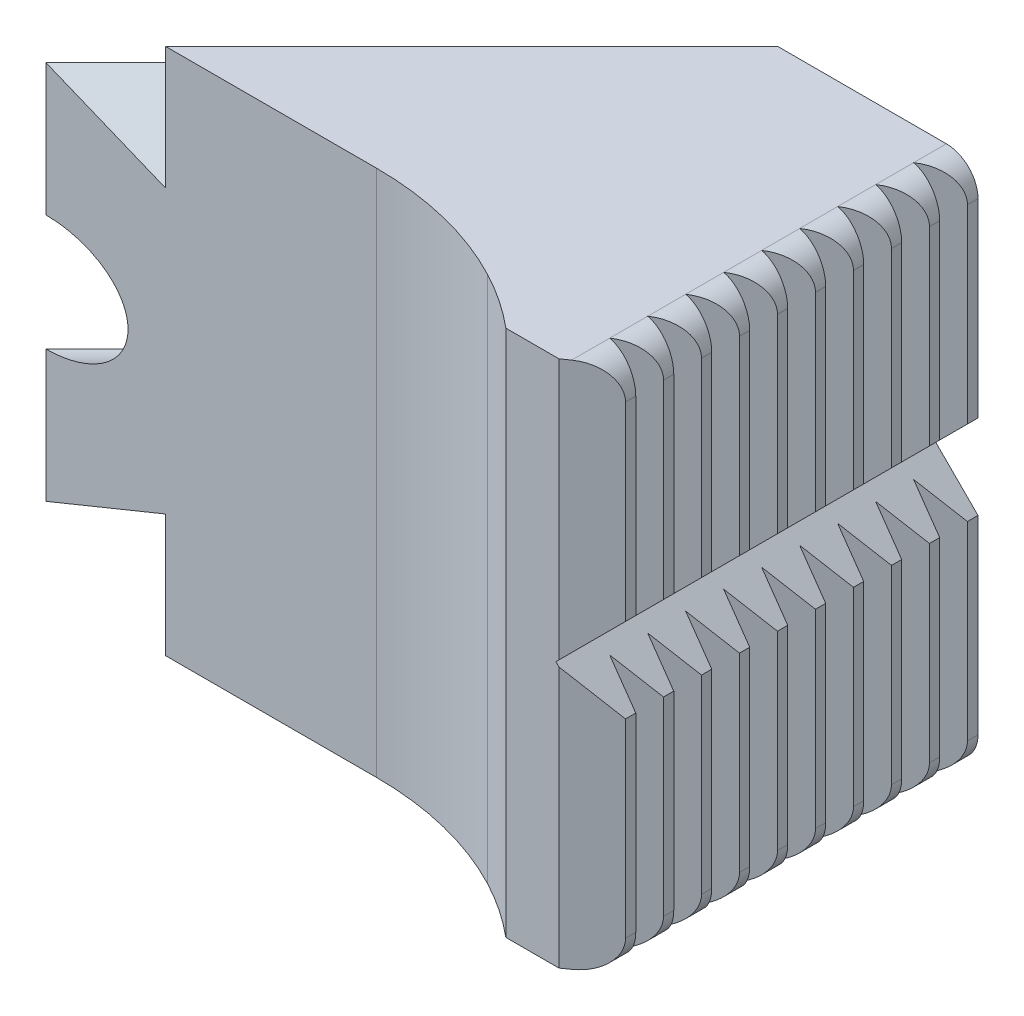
ISO-10303-21;
HEADER;
FILE_DESCRIPTION(('STEP AP214'),'2;1');
FILE_NAME('part.step','',(''),(''),'','','');
FILE_SCHEMA(('AUTOMOTIVE_DESIGN { 1 0 10303 214 1 1 1 1 }'));
ENDSEC;
DATA;
#1=APPLICATION_CONTEXT('core data for automotive mechanical design processes');
#2=APPLICATION_PROTOCOL_DEFINITION('international standard','automotive_design',2000,#1);
#3=PRODUCT_CONTEXT('',#1,'mechanical');
#4=PRODUCT('Part','Part','',(#3));
#5=PRODUCT_RELATED_PRODUCT_CATEGORY('part','',(#4));
#6=PRODUCT_DEFINITION_FORMATION('','',#4);
#7=PRODUCT_DEFINITION_CONTEXT('part definition',#1,'design');
#8=PRODUCT_DEFINITION('design','',#6,#7);
#9=PRODUCT_DEFINITION_SHAPE('','',#8);
#10=(LENGTH_UNIT() NAMED_UNIT(*) SI_UNIT(.MILLI.,.METRE.));
#11=(NAMED_UNIT(*) PLANE_ANGLE_UNIT() SI_UNIT($,.RADIAN.));
#12=(NAMED_UNIT(*) SI_UNIT($,.STERADIAN.) SOLID_ANGLE_UNIT());
#13=UNCERTAINTY_MEASURE_WITH_UNIT(LENGTH_MEASURE(1.E-05),#10,'distance_accuracy_value','');
#14=(GEOMETRIC_REPRESENTATION_CONTEXT(3) GLOBAL_UNCERTAINTY_ASSIGNED_CONTEXT((#13)) GLOBAL_UNIT_ASSIGNED_CONTEXT((#10,
#11,#12)) REPRESENTATION_CONTEXT('',''));
#15=CARTESIAN_POINT('',(0.,0.,0.));
#16=DIRECTION('',(0.,0.,1.));
#17=DIRECTION('',(1.,0.,0.));
#18=AXIS2_PLACEMENT_3D('',#15,#16,#17);
#19=CARTESIAN_POINT('',(2.82685424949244,12.5000000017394,-2.8268542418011));
#20=DIRECTION('',(0.70710678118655,4.35090036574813E-10,-0.707106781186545));
#21=DIRECTION('',(-0.707106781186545,4.35089658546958E-10,-0.70710678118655));
#22=AXIS2_PLACEMENT_3D('',#19,#20,#21);
#23=PLANE('',#22);
#24=DIRECTION('',(0.612372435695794,-0.500000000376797,0.612372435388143));
#25=VECTOR('',#24,1.);
#26=CARTESIAN_POINT('',(2.82685424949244,9.00000000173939,-2.82685424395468));
#27=LINE('',#26,#25);
#28=CARTESIAN_POINT('',(5.65370849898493,6.69188317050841,4.11758127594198E-09));
#29=VERTEX_POINT('',#28);
#30=CARTESIAN_POINT('',(5.65528137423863,6.69059892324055,0.00157287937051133));
#31=VERTEX_POINT('',#30);
#32=EDGE_CURVE('E1036',#29,#31,#27,.T.);
#33=ORIENTED_EDGE('',*,*,#32,.T.);
#34=DIRECTION('',(0.,1.,6.1531152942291E-10));
#35=VECTOR('',#34,1.);
#36=CARTESIAN_POINT('',(5.65528137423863,12.499999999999,0.00157288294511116));
#37=LINE('',#36,#35);
#38=CARTESIAN_POINT('',(5.65528137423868,12.499999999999,0.00157288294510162));
#39=VERTEX_POINT('',#38);
#40=EDGE_CURVE('E37',#31,#39,#37,.T.);
#41=ORIENTED_EDGE('',*,*,#40,.T.);
#42=DIRECTION('',(-0.707106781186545,4.35089658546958E-10,-0.70710678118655));
#43=VECTOR('',#42,1.);
#44=CARTESIAN_POINT('',(2.82685424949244,12.5000000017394,-2.8268542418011));
#45=LINE('',#44,#43);
#46=CARTESIAN_POINT('',(5.65370849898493,12.5,7.69139179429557E-09));
#47=VERTEX_POINT('',#46);
#48=EDGE_CURVE('E1034',#39,#47,#45,.T.);
#49=ORIENTED_EDGE('',*,*,#48,.T.);
#50=DIRECTION('',(0.,1.,6.15310334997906E-10));
#51=VECTOR('',#50,1.);
#52=CARTESIAN_POINT('',(5.65370849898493,12.5,7.69138138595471E-09));
#53=LINE('',#52,#51);
#54=EDGE_CURVE('E1043',#29,#47,#53,.T.);
#55=ORIENTED_EDGE('',*,*,#54,.F.);
#56=EDGE_LOOP('',(#33,#41,#49,#55));
#57=FACE_BOUND('',#56,.T.);
#58=ADVANCED_FACE('F14',(#57),#23,.F.);
#59=CARTESIAN_POINT('',(5.65528137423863,12.499999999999,0.00157288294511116));
#60=DIRECTION('',(0.707106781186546,-4.35091136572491E-10,0.707106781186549));
#61=DIRECTION('',(0.707106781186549,4.35090562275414E-10,-0.707106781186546));
#62=AXIS2_PLACEMENT_3D('',#59,#60,#61);
#63=PLANE('',#62);
#64=DIRECTION('',(-0.707106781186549,-4.35090562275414E-10,0.707106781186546));
#65=VECTOR('',#64,1.);
#66=CARTESIAN_POINT('',(5.65528137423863,12.499999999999,0.00157288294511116));
#67=LINE('',#66,#65);
#68=CARTESIAN_POINT('',(-8.84314575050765,12.499999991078,14.5000000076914));
#69=VERTEX_POINT('',#68);
#70=EDGE_CURVE('E1040',#39,#69,#67,.T.);
#71=ORIENTED_EDGE('',*,*,#70,.F.);
#72=ORIENTED_EDGE('',*,*,#40,.F.);
#73=DIRECTION('',(-0.707106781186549,-4.35090562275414E-10,0.707106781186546));
#74=VECTOR('',#73,1.);
#75=CARTESIAN_POINT('',(5.65528137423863,6.69059892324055,0.00157287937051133));
#76=LINE('',#75,#74);
#77=CARTESIAN_POINT('',(-8.84314575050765,6.6905989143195,14.5000000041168));
#78=VERTEX_POINT('',#77);
#79=EDGE_CURVE('E1044',#31,#78,#76,.T.);
#80=ORIENTED_EDGE('',*,*,#79,.T.);
#81=DIRECTION('',(0.,-1.,-6.15310334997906E-10));
#82=VECTOR('',#81,1.);
#83=CARTESIAN_POINT('',(-8.84314575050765,12.499999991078,14.5000000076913));
#84=LINE('',#83,#82);
#85=EDGE_CURVE('E1050',#69,#78,#84,.T.);
#86=ORIENTED_EDGE('',*,*,#85,.F.);
#87=EDGE_LOOP('',(#71,#72,#80,#86));
#88=FACE_BOUND('',#87,.T.);
#89=ADVANCED_FACE('F1141',(#88),#63,.F.);
#90=CARTESIAN_POINT('',(1.15685424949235,12.4999999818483,29.5000000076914));
#91=DIRECTION('',(0.,-1.,-6.15310334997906E-10));
#92=DIRECTION('',(1.,0.,0.));
#93=AXIS2_PLACEMENT_3D('',#90,#91,#92);
#94=CYLINDRICAL_SURFACE('',#93,15.);
#95=CARTESIAN_POINT('',(1.15685424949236,-12.5000000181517,29.4999999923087));
#96=DIRECTION('',(0.,-1.,-6.15310334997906E-10));
#97=DIRECTION('',(-1.,0.,0.));
#98=AXIS2_PLACEMENT_3D('',#95,#96,#97);
#99=CIRCLE('',#98,15.);
#100=CARTESIAN_POINT('',(1.1568542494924,-12.500000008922,14.4999999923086));
#101=VERTEX_POINT('',#100);
#102=CARTESIAN_POINT('',(8.15021538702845,-12.5000000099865,16.2299999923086));
#103=VERTEX_POINT('',#102);
#104=EDGE_CURVE('E1073',#101,#103,#99,.T.);
#105=ORIENTED_EDGE('',*,*,#104,.T.);
#106=DIRECTION('',(0.,-1.,-6.15310334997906E-10));
#107=VECTOR('',#106,1.);
#108=CARTESIAN_POINT('',(8.15021538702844,12.4999999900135,16.2300000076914));
#109=LINE('',#108,#107);
#110=CARTESIAN_POINT('',(8.15021538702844,12.4999999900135,16.2300000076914));
#111=VERTEX_POINT('',#110);
#112=EDGE_CURVE('E1090',#111,#103,#109,.T.);
#113=ORIENTED_EDGE('',*,*,#112,.F.);
#114=CARTESIAN_POINT('',(1.15685424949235,12.4999999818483,29.5000000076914));
#115=DIRECTION('',(0.,-1.,-6.15310334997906E-10));
#116=DIRECTION('',(-1.,0.,0.));
#117=AXIS2_PLACEMENT_3D('',#114,#115,#116);
#118=CIRCLE('',#117,15.);
#119=CARTESIAN_POINT('',(1.15685424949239,12.499999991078,14.5000000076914));
#120=VERTEX_POINT('',#119);
#121=EDGE_CURVE('E1083',#120,#111,#118,.T.);
#122=ORIENTED_EDGE('',*,*,#121,.F.);
#123=DIRECTION('',(0.,-1.,-6.15310334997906E-10));
#124=VECTOR('',#123,1.);
#125=CARTESIAN_POINT('',(1.15685424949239,12.499999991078,14.5000000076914));
#126=LINE('',#125,#124);
#127=EDGE_CURVE('E1093',#120,#101,#126,.T.);
#128=ORIENTED_EDGE('',*,*,#127,.T.);
#129=EDGE_LOOP('',(#105,#113,#122,#128));
#130=FACE_BOUND('',#129,.T.);
#131=ADVANCED_FACE('F1131',(#130),#94,.F.);
#132=CARTESIAN_POINT('',(2.82685424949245,-12.4999999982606,-2.82685425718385));
#133=DIRECTION('',(-0.70710678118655,-4.35090387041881E-10,0.707106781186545));
#134=DIRECTION('',(0.707106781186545,-4.35089658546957E-10,0.70710678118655));
#135=AXIS2_PLACEMENT_3D('',#132,#133,#134);
#136=PLANE('',#135);
#137=DIRECTION('',(0.,-1.,-6.15310334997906E-10));
#138=VECTOR('',#137,1.);
#139=CARTESIAN_POINT('',(5.65370849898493,12.5,7.69138138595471E-09));
#140=LINE('',#139,#138);
#141=CARTESIAN_POINT('',(5.65370849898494,-6.69188317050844,-4.11757867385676E-09));
#142=VERTEX_POINT('',#141);
#143=CARTESIAN_POINT('',(5.65370849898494,-12.5,-7.6913787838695E-09));
#144=VERTEX_POINT('',#143);
#145=EDGE_CURVE('E29',#142,#144,#140,.T.);
#146=ORIENTED_EDGE('',*,*,#145,.T.);
#147=DIRECTION('',(0.707106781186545,-4.35089658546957E-10,0.70710678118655));
#148=VECTOR('',#147,1.);
#149=CARTESIAN_POINT('',(18.1552813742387,-12.5000000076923,12.5015728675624));
#150=LINE('',#149,#148);
#151=CARTESIAN_POINT('',(5.65528137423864,-12.500000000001,0.00157286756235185));
#152=VERTEX_POINT('',#151);
#153=EDGE_CURVE('E22',#144,#152,#150,.T.);
#154=ORIENTED_EDGE('',*,*,#153,.T.);
#155=DIRECTION('',(0.,1.,6.15309140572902E-10));
#156=VECTOR('',#155,1.);
#157=CARTESIAN_POINT('',(5.65528137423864,-12.500000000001,0.00157286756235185));
#158=LINE('',#157,#156);
#159=CARTESIAN_POINT('',(5.65528137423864,-6.69059892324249,0.00157287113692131));
#160=VERTEX_POINT('',#159);
#161=EDGE_CURVE('E1014',#152,#160,#158,.T.);
#162=ORIENTED_EDGE('',*,*,#161,.T.);
#163=DIRECTION('',(-0.612372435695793,-0.499999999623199,-0.612372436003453));
#164=VECTOR('',#163,1.);
#165=CARTESIAN_POINT('',(2.82685424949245,-8.99999999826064,-2.82685425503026));
#166=LINE('',#165,#164);
#167=EDGE_CURVE('E1017',#160,#142,#166,.T.);
#168=ORIENTED_EDGE('',*,*,#167,.T.);
#169=EDGE_LOOP('',(#146,#154,#162,#168));
#170=FACE_BOUND('',#169,.T.);
#171=ADVANCED_FACE('F1114',(#170),#136,.T.);
#172=CARTESIAN_POINT('',(5.65528137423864,-12.500000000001,0.00157286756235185));
#173=DIRECTION('',(0.707106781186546,-4.35088180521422E-10,0.707106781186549));
#174=DIRECTION('',(0.707106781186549,4.35090562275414E-10,-0.707106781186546));
#175=AXIS2_PLACEMENT_3D('',#172,#173,#174);
#176=PLANE('',#175);
#177=DIRECTION('',(-0.707106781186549,-4.35090562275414E-10,0.707106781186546));
#178=VECTOR('',#177,1.);
#179=CARTESIAN_POINT('',(5.65528137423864,-6.69059892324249,0.00157287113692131));
#180=LINE('',#179,#178);
#181=CARTESIAN_POINT('',(-8.84314575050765,-6.69059893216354,14.4999999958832));
#182=VERTEX_POINT('',#181);
#183=EDGE_CURVE('E1023',#160,#182,#180,.T.);
#184=ORIENTED_EDGE('',*,*,#183,.F.);
#185=ORIENTED_EDGE('',*,*,#161,.F.);
#186=DIRECTION('',(-0.707106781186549,-4.35090562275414E-10,0.707106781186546));
#187=VECTOR('',#186,1.);
#188=CARTESIAN_POINT('',(5.65528137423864,-12.500000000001,0.00157286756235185));
#189=LINE('',#188,#187);
#190=CARTESIAN_POINT('',(-8.84314575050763,-12.500000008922,14.4999999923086));
#191=VERTEX_POINT('',#190);
#192=EDGE_CURVE('E1019',#152,#191,#189,.T.);
#193=ORIENTED_EDGE('',*,*,#192,.T.);
#194=DIRECTION('',(0.,-1.,-6.15310334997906E-10));
#195=VECTOR('',#194,1.);
#196=CARTESIAN_POINT('',(-8.8431457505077,12.499999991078,14.5000000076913));
#197=LINE('',#196,#195);
#198=EDGE_CURVE('E1028',#182,#191,#197,.T.);
#199=ORIENTED_EDGE('',*,*,#198,.F.);
#200=EDGE_LOOP('',(#184,#185,#193,#199));
#201=FACE_BOUND('',#200,.T.);
#202=ADVANCED_FACE('F1118',(#201),#176,.F.);
#203=CARTESIAN_POINT('',(2.82685424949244,9.00000000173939,-2.82685424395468));
#204=DIRECTION('',(-0.353553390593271,-0.866025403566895,-0.353553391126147));
#205=DIRECTION('',(0.925820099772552,-0.377964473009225,-2.32564067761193E-10));
#206=AXIS2_PLACEMENT_3D('',#203,#204,#205);
#207=PLANE('',#206);
#208=ORIENTED_EDGE('',*,*,#79,.F.);
#209=ORIENTED_EDGE('',*,*,#32,.F.);
#210=DIRECTION('',(0.925820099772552,-0.377964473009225,-2.32564163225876E-10));
#211=VECTOR('',#210,1.);
#212=CARTESIAN_POINT('',(-13.653316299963,14.5739430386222,8.96747173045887E-09));
#213=LINE('',#212,#211);
#214=CARTESIAN_POINT('',(0.,9.,5.53778724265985E-09));
#215=VERTEX_POINT('',#214);
#216=EDGE_CURVE('E1111',#215,#29,#213,.T.);
#217=ORIENTED_EDGE('',*,*,#216,.F.);
#218=DIRECTION('',(-0.707106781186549,-4.35090562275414E-10,0.707106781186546));
#219=VECTOR('',#218,1.);
#220=CARTESIAN_POINT('',(2.82685424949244,9.00000000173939,-2.82685424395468));
#221=LINE('',#220,#219);
#222=CARTESIAN_POINT('',(-14.5,8.99999999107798,14.5000000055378));
#223=VERTEX_POINT('',#222);
#224=EDGE_CURVE('E1039',#215,#223,#221,.T.);
#225=ORIENTED_EDGE('',*,*,#224,.T.);
#226=DIRECTION('',(-0.925820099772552,0.377964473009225,2.32564067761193E-10));
#227=VECTOR('',#226,1.);
#228=CARTESIAN_POINT('',(-2.30458408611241,4.02124229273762,14.5000000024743));
#229=LINE('',#228,#227);
#230=EDGE_CURVE('E1053',#78,#223,#229,.T.);
#231=ORIENTED_EDGE('',*,*,#230,.F.);
#232=EDGE_LOOP('',(#208,#209,#217,#225,#231));
#233=FACE_BOUND('',#232,.T.);
#234=ADVANCED_FACE('F1145',(#233),#207,.F.);
#235=CARTESIAN_POINT('',(1.15685424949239,12.499999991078,14.5000000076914));
#236=DIRECTION('',(0.,6.15310334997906E-10,-1.));
#237=DIRECTION('',(0.,-1.,-6.15310334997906E-10));
#238=AXIS2_PLACEMENT_3D('',#235,#236,#237);
#239=PLANE('',#238);
#240=DIRECTION('',(0.,-1.,-6.15310334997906E-10));
#241=VECTOR('',#240,1.);
#242=CARTESIAN_POINT('',(-14.5,12.499999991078,14.5000000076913));
#243=LINE('',#242,#241);
#244=CARTESIAN_POINT('',(-14.5,-2.74999910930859,14.4999999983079));
#245=VERTEX_POINT('',#244);
#246=CARTESIAN_POINT('',(-14.5,-9.00000000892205,14.4999999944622));
#247=VERTEX_POINT('',#246);
#248=EDGE_CURVE('E1096',#245,#247,#243,.T.);
#249=ORIENTED_EDGE('',*,*,#248,.T.);
#250=DIRECTION('',(0.925820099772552,0.377964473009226,2.32566825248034E-10));
#251=VECTOR('',#250,1.);
#252=CARTESIAN_POINT('',(6.44359356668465,-0.449813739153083,14.4999999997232));
#253=LINE('',#252,#251);
#254=EDGE_CURVE('E1031',#247,#182,#253,.T.);
#255=ORIENTED_EDGE('',*,*,#254,.T.);
#256=ORIENTED_EDGE('',*,*,#198,.T.);
#257=DIRECTION('',(1.,0.,0.));
#258=VECTOR('',#257,1.);
#259=CARTESIAN_POINT('',(1.1568542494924,-12.500000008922,14.4999999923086));
#260=LINE('',#259,#258);
#261=EDGE_CURVE('E1071',#191,#101,#260,.T.);
#262=ORIENTED_EDGE('',*,*,#261,.T.);
#263=ORIENTED_EDGE('',*,*,#127,.F.);
#264=DIRECTION('',(1.,0.,0.));
#265=VECTOR('',#264,1.);
#266=CARTESIAN_POINT('',(1.15685424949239,12.499999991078,14.5000000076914));
#267=LINE('',#266,#265);
#268=EDGE_CURVE('E1081',#69,#120,#267,.T.);
#269=ORIENTED_EDGE('',*,*,#268,.F.);
#270=ORIENTED_EDGE('',*,*,#85,.T.);
#271=ORIENTED_EDGE('',*,*,#230,.T.);
#272=CARTESIAN_POINT('',(-14.5,2.74999909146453,14.5000000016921));
#273=VERTEX_POINT('',#272);
#274=EDGE_CURVE('E1097',#223,#273,#243,.T.);
#275=ORIENTED_EDGE('',*,*,#274,.T.);
#276=CARTESIAN_POINT('',(-14.5031457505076,-8.92204712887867E-09,14.5));
#277=DIRECTION('',(0.,6.15310334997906E-10,-1.));
#278=DIRECTION('',(1.,0.,0.));
#279=AXIS2_PLACEMENT_3D('',#276,#277,#278);
#280=ELLIPSE('',#279,3.88908729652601,2.75);
#281=EDGE_CURVE('E1063',#245,#273,#280,.F.);
#282=ORIENTED_EDGE('',*,*,#281,.F.);
#283=EDGE_LOOP('',(#249,#255,#256,#262,#263,#269,#270,#271,#275,#282));
#284=FACE_BOUND('',#283,.T.);
#285=ADVANCED_FACE('F1127',(#284),#239,.F.);
#286=CARTESIAN_POINT('',(2.82685424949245,-8.99999999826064,-2.82685425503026));
#287=DIRECTION('',(-0.353553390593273,0.866025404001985,-0.353553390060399));
#288=DIRECTION('',(-0.925820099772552,-0.377964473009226,-2.32566825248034E-10));
#289=AXIS2_PLACEMENT_3D('',#286,#287,#288);
#290=PLANE('',#289);
#291=DIRECTION('',(-0.707106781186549,-4.35090562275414E-10,0.707106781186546));
#292=VECTOR('',#291,1.);
#293=CARTESIAN_POINT('',(2.82685424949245,-8.99999999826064,-2.82685425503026));
#294=LINE('',#293,#292);
#295=CARTESIAN_POINT('',(0.,-9.,-5.53780285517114E-09));
#296=VERTEX_POINT('',#295);
#297=EDGE_CURVE('E1020',#296,#247,#294,.T.);
#298=ORIENTED_EDGE('',*,*,#297,.F.);
#299=DIRECTION('',(-0.925820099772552,-0.377964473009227,-2.32566708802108E-10));
#300=VECTOR('',#299,1.);
#301=CARTESIAN_POINT('',(-4.90513864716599,-11.0025144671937,-6.76997520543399E-09));
#302=LINE('',#301,#300);
#303=EDGE_CURVE('E9',#142,#296,#302,.T.);
#304=ORIENTED_EDGE('',*,*,#303,.F.);
#305=ORIENTED_EDGE('',*,*,#167,.F.);
#306=ORIENTED_EDGE('',*,*,#183,.T.);
#307=ORIENTED_EDGE('',*,*,#254,.F.);
#308=EDGE_LOOP('',(#298,#304,#305,#306,#307));
#309=FACE_BOUND('',#308,.T.);
#310=ADVANCED_FACE('F1159',(#309),#290,.F.);
#311=CARTESIAN_POINT('',(1.15685424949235,12.4999999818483,29.5000000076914));
#312=DIRECTION('',(0.,1.,6.15310334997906E-10));
#313=DIRECTION('',(-1.,0.,0.));
#314=AXIS2_PLACEMENT_3D('',#311,#312,#313);
#315=PLANE('',#314);
#316=DIRECTION('',(0.,-6.15310457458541E-10,1.));
#317=VECTOR('',#316,1.);
#318=CARTESIAN_POINT('',(13.6568542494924,12.5,7.69139179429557E-09));
#319=LINE('',#318,#317);
#320=CARTESIAN_POINT('',(13.6568542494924,12.4999999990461,1.55031131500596));
#321=VERTEX_POINT('',#320);
#322=CARTESIAN_POINT('',(13.6568542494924,12.5,7.69139179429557E-09));
#323=VERTEX_POINT('',#322);
#324=EDGE_CURVE('E894',#321,#323,#319,.F.);
#325=ORIENTED_EDGE('',*,*,#324,.T.);
#326=DIRECTION('',(-1.,0.,0.));
#327=VECTOR('',#326,1.);
#328=CARTESIAN_POINT('',(-14.5,12.5,7.69135970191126E-09));
#329=LINE('',#328,#327);
#330=EDGE_CURVE('E1078',#323,#47,#329,.T.);
#331=ORIENTED_EDGE('',*,*,#330,.T.);
#332=ORIENTED_EDGE('',*,*,#48,.F.);
#333=ORIENTED_EDGE('',*,*,#70,.T.);
#334=ORIENTED_EDGE('',*,*,#268,.T.);
#335=ORIENTED_EDGE('',*,*,#121,.T.);
#336=DIRECTION('',(1.,0.,0.));
#337=VECTOR('',#336,1.);
#338=CARTESIAN_POINT('',(8.15021538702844,12.4999999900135,16.2300000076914));
#339=LINE('',#338,#337);
#340=CARTESIAN_POINT('',(8.15685424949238,12.4999999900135,16.2300000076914));
#341=VERTEX_POINT('',#340);
#342=EDGE_CURVE('E1085',#111,#341,#339,.T.);
#343=ORIENTED_EDGE('',*,*,#342,.T.);
#344=DIRECTION('',(0.,6.15310457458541E-10,-1.));
#345=VECTOR('',#344,1.);
#346=CARTESIAN_POINT('',(8.15685424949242,12.499999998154,3.00000000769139));
#347=LINE('',#346,#345);
#348=CARTESIAN_POINT('',(8.15685424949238,12.4999999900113,16.2335008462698));
#349=VERTEX_POINT('',#348);
#350=EDGE_CURVE('E859',#349,#341,#347,.T.);
#351=ORIENTED_EDGE('',*,*,#350,.F.);
#352=CARTESIAN_POINT('',(1.15685424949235,12.4999999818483,29.5000000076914));
#353=DIRECTION('',(0.,1.,6.15310457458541E-10));
#354=DIRECTION('',(-1.,0.,0.));
#355=AXIS2_PLACEMENT_3D('',#352,#353,#354);
#356=CIRCLE('',#355,15.);
#357=CARTESIAN_POINT('',(10.7875343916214,12.4999999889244,18.0000000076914));
#358=VERTEX_POINT('',#357);
#359=EDGE_CURVE('E850',#358,#349,#356,.T.);
#360=ORIENTED_EDGE('',*,*,#359,.F.);
#361=DIRECTION('',(-1.,0.,0.));
#362=VECTOR('',#361,1.);
#363=CARTESIAN_POINT('',(15.1568542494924,12.4999999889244,18.0000000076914));
#364=LINE('',#363,#362);
#365=CARTESIAN_POINT('',(13.3002618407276,12.4999999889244,18.0000000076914));
#366=VERTEX_POINT('',#365);
#367=EDGE_CURVE('E873',#366,#358,#364,.T.);
#368=ORIENTED_EDGE('',*,*,#367,.F.);
#369=DIRECTION('',(-0.819152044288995,-3.52928023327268E-10,0.573576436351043));
#370=VECTOR('',#369,1.);
#371=CARTESIAN_POINT('',(13.3002618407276,12.4999999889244,18.0000000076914));
#372=LINE('',#371,#370);
#373=CARTESIAN_POINT('',(13.6568542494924,12.499999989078,17.7503113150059));
#374=VERTEX_POINT('',#373);
#375=EDGE_CURVE('E692',#374,#366,#372,.T.);
#376=ORIENTED_EDGE('',*,*,#375,.F.);
#377=CARTESIAN_POINT('',(13.6568542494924,12.4999999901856,15.9503113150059));
#378=VERTEX_POINT('',#377);
#379=EDGE_CURVE('E896',#374,#378,#319,.F.);
#380=ORIENTED_EDGE('',*,*,#379,.T.);
#381=CARTESIAN_POINT('',(13.6568542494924,12.4999999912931,14.150311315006));
#382=VERTEX_POINT('',#381);
#383=EDGE_CURVE('E900',#378,#382,#319,.F.);
#384=ORIENTED_EDGE('',*,*,#383,.T.);
#385=CARTESIAN_POINT('',(13.6568542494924,12.4999999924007,12.350311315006));
#386=VERTEX_POINT('',#385);
#387=EDGE_CURVE('E1607',#382,#386,#319,.F.);
#388=ORIENTED_EDGE('',*,*,#387,.T.);
#389=CARTESIAN_POINT('',(13.6568542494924,12.4999999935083,10.5503113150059));
#390=VERTEX_POINT('',#389);
#391=EDGE_CURVE('E1608',#386,#390,#319,.F.);
#392=ORIENTED_EDGE('',*,*,#391,.T.);
#393=CARTESIAN_POINT('',(13.6568542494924,12.4999999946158,8.75031131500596));
#394=VERTEX_POINT('',#393);
#395=EDGE_CURVE('E1610',#390,#394,#319,.F.);
#396=ORIENTED_EDGE('',*,*,#395,.T.);
#397=CARTESIAN_POINT('',(13.6568542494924,12.4999999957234,6.95031131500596));
#398=VERTEX_POINT('',#397);
#399=EDGE_CURVE('E1579',#394,#398,#319,.F.);
#400=ORIENTED_EDGE('',*,*,#399,.T.);
#401=CARTESIAN_POINT('',(13.6568542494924,12.4999999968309,5.15031131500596));
#402=VERTEX_POINT('',#401);
#403=EDGE_CURVE('E1578',#398,#402,#319,.F.);
#404=ORIENTED_EDGE('',*,*,#403,.T.);
#405=CARTESIAN_POINT('',(13.6568542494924,12.4999999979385,3.35031131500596));
#406=VERTEX_POINT('',#405);
#407=EDGE_CURVE('E1571',#402,#406,#319,.F.);
#408=ORIENTED_EDGE('',*,*,#407,.T.);
#409=EDGE_CURVE('E1563',#406,#321,#319,.F.);
#410=ORIENTED_EDGE('',*,*,#409,.T.);
#411=EDGE_LOOP('',(#325,#331,#332,#333,#334,#335,#343,#351,#360,#368,#376,#380,#384,#388,#392,
#396,#400,#404,#408,#410));
#412=FACE_BOUND('',#411,.T.);
#413=ADVANCED_FACE('F1136',(#412),#315,.T.);
#414=CARTESIAN_POINT('',(1.15685424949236,-12.5000000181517,29.4999999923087));
#415=DIRECTION('',(0.,1.,6.15310334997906E-10));
#416=DIRECTION('',(-1.,0.,0.));
#417=AXIS2_PLACEMENT_3D('',#414,#415,#416);
#418=PLANE('',#417);
#419=DIRECTION('',(-1.,0.,0.));
#420=VECTOR('',#419,1.);
#421=CARTESIAN_POINT('',(-14.5,-12.5,-7.69140046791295E-09));
#422=LINE('',#421,#420);
#423=CARTESIAN_POINT('',(13.6568542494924,-12.5,-7.6913675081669E-09));
#424=VERTEX_POINT('',#423);
#425=EDGE_CURVE('E1068',#424,#144,#422,.T.);
#426=ORIENTED_EDGE('',*,*,#425,.F.);
#427=DIRECTION('',(0.,6.15310553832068E-10,-1.));
#428=VECTOR('',#427,1.);
#429=CARTESIAN_POINT('',(13.6568542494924,-12.5000000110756,17.9999999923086));
#430=LINE('',#429,#428);
#431=CARTESIAN_POINT('',(13.6568542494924,-12.5000000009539,1.5503112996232));
#432=VERTEX_POINT('',#431);
#433=EDGE_CURVE('E891',#424,#432,#430,.F.);
#434=ORIENTED_EDGE('',*,*,#433,.T.);
#435=CARTESIAN_POINT('',(13.6568542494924,-12.5000000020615,3.3503112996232));
#436=VERTEX_POINT('',#435);
#437=EDGE_CURVE('E895',#432,#436,#430,.F.);
#438=ORIENTED_EDGE('',*,*,#437,.T.);
#439=CARTESIAN_POINT('',(13.6568542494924,-12.5000000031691,5.1503112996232));
#440=VERTEX_POINT('',#439);
#441=EDGE_CURVE('E1180',#436,#440,#430,.F.);
#442=ORIENTED_EDGE('',*,*,#441,.T.);
#443=CARTESIAN_POINT('',(13.6568542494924,-12.5000000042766,6.9503112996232));
#444=VERTEX_POINT('',#443);
#445=EDGE_CURVE('E1181',#440,#444,#430,.F.);
#446=ORIENTED_EDGE('',*,*,#445,.T.);
#447=CARTESIAN_POINT('',(13.6568542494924,-12.5000000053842,8.7503112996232));
#448=VERTEX_POINT('',#447);
#449=EDGE_CURVE('E1183',#444,#448,#430,.F.);
#450=ORIENTED_EDGE('',*,*,#449,.T.);
#451=CARTESIAN_POINT('',(13.6568542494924,-12.5000000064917,10.5503112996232));
#452=VERTEX_POINT('',#451);
#453=EDGE_CURVE('E1186',#448,#452,#430,.F.);
#454=ORIENTED_EDGE('',*,*,#453,.T.);
#455=CARTESIAN_POINT('',(13.6568542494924,-12.5000000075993,12.3503112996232));
#456=VERTEX_POINT('',#455);
#457=EDGE_CURVE('E1189',#452,#456,#430,.F.);
#458=ORIENTED_EDGE('',*,*,#457,.T.);
#459=CARTESIAN_POINT('',(13.6568542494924,-12.5000000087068,14.1503112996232));
#460=VERTEX_POINT('',#459);
#461=EDGE_CURVE('E1192',#456,#460,#430,.F.);
#462=ORIENTED_EDGE('',*,*,#461,.T.);
#463=CARTESIAN_POINT('',(13.6568542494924,-12.5000000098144,15.9503112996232));
#464=VERTEX_POINT('',#463);
#465=EDGE_CURVE('E1195',#460,#464,#430,.F.);
#466=ORIENTED_EDGE('',*,*,#465,.T.);
#467=CARTESIAN_POINT('',(13.6568542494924,-12.500000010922,17.7503112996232));
#468=VERTEX_POINT('',#467);
#469=EDGE_CURVE('E890',#464,#468,#430,.F.);
#470=ORIENTED_EDGE('',*,*,#469,.T.);
#471=DIRECTION('',(-0.819152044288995,-3.52928023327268E-10,0.573576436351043));
#472=VECTOR('',#471,1.);
#473=CARTESIAN_POINT('',(13.3002618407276,-12.5000000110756,17.9999999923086));
#474=LINE('',#473,#472);
#475=CARTESIAN_POINT('',(13.3002618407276,-12.5000000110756,17.9999999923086));
#476=VERTEX_POINT('',#475);
#477=EDGE_CURVE('E695',#468,#476,#474,.T.);
#478=ORIENTED_EDGE('',*,*,#477,.T.);
#479=DIRECTION('',(-1.,0.,0.));
#480=VECTOR('',#479,1.);
#481=CARTESIAN_POINT('',(15.1568542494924,-12.5000000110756,17.9999999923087));
#482=LINE('',#481,#480);
#483=CARTESIAN_POINT('',(10.7875343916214,-12.5000000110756,17.9999999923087));
#484=VERTEX_POINT('',#483);
#485=EDGE_CURVE('E871',#476,#484,#482,.T.);
#486=ORIENTED_EDGE('',*,*,#485,.T.);
#487=CARTESIAN_POINT('',(1.15685424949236,-12.5000000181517,29.4999999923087));
#488=DIRECTION('',(0.,1.,6.15310457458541E-10));
#489=DIRECTION('',(-1.,0.,0.));
#490=AXIS2_PLACEMENT_3D('',#487,#488,#489);
#491=CIRCLE('',#490,15.);
#492=CARTESIAN_POINT('',(8.1568542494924,-12.5000000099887,16.2335008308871));
#493=VERTEX_POINT('',#492);
#494=EDGE_CURVE('E852',#484,#493,#491,.T.);
#495=ORIENTED_EDGE('',*,*,#494,.T.);
#496=DIRECTION('',(0.,6.15310457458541E-10,-1.));
#497=VECTOR('',#496,1.);
#498=CARTESIAN_POINT('',(8.15685424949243,-12.5000000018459,2.99999999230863));
#499=LINE('',#498,#497);
#500=CARTESIAN_POINT('',(8.1568542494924,-12.5000000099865,16.2299999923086));
#501=VERTEX_POINT('',#500);
#502=EDGE_CURVE('E864',#493,#501,#499,.T.);
#503=ORIENTED_EDGE('',*,*,#502,.T.);
#504=DIRECTION('',(1.,0.,0.));
#505=VECTOR('',#504,1.);
#506=CARTESIAN_POINT('',(8.15021538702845,-12.5000000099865,16.2299999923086));
#507=LINE('',#506,#505);
#508=EDGE_CURVE('E1075',#103,#501,#507,.T.);
#509=ORIENTED_EDGE('',*,*,#508,.F.);
#510=ORIENTED_EDGE('',*,*,#104,.F.);
#511=ORIENTED_EDGE('',*,*,#261,.F.);
#512=ORIENTED_EDGE('',*,*,#192,.F.);
#513=ORIENTED_EDGE('',*,*,#153,.F.);
#514=EDGE_LOOP('',(#426,#434,#438,#442,#446,#450,#454,#458,#462,#466,#470,#478,#486,#495,#503,
#509,#510,#511,#512,#513));
#515=FACE_BOUND('',#514,.T.);
#516=ADVANCED_FACE('F1121',(#515),#418,.F.);
#517=CARTESIAN_POINT('',(8.15021538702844,12.4999999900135,16.2300000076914));
#518=DIRECTION('',(0.,6.15310334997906E-10,-1.));
#519=DIRECTION('',(0.,-1.,-6.15310334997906E-10));
#520=AXIS2_PLACEMENT_3D('',#517,#518,#519);
#521=PLANE('',#520);
#522=ORIENTED_EDGE('',*,*,#508,.T.);
#523=DIRECTION('',(0.,-1.,-6.15310334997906E-10));
#524=VECTOR('',#523,1.);
#525=CARTESIAN_POINT('',(8.15685424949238,12.4999999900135,16.2300000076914));
#526=LINE('',#525,#524);
#527=EDGE_CURVE('E1088',#341,#501,#526,.T.);
#528=ORIENTED_EDGE('',*,*,#527,.F.);
#529=ORIENTED_EDGE('',*,*,#342,.F.);
#530=ORIENTED_EDGE('',*,*,#112,.T.);
#531=EDGE_LOOP('',(#522,#528,#529,#530));
#532=FACE_BOUND('',#531,.T.);
#533=ADVANCED_FACE('F1384',(#532),#521,.F.);
#534=CARTESIAN_POINT('',(-14.5,-12.500000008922,14.4999999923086));
#535=DIRECTION('',(0.707106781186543,-4.35089658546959E-10,0.707106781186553));
#536=DIRECTION('',(0.707106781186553,4.35090562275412E-10,-0.707106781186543));
#537=AXIS2_PLACEMENT_3D('',#534,#535,#536);
#538=PLANE('',#537);
#539=DIRECTION('',(0.,1.,6.15310334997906E-10));
#540=VECTOR('',#539,1.);
#541=CARTESIAN_POINT('',(1.6306400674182E-13,-12.5,-7.69138225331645E-09));
#542=LINE('',#541,#540);
#543=EDGE_CURVE('E1066',#296,#215,#542,.T.);
#544=ORIENTED_EDGE('',*,*,#543,.F.);
#545=ORIENTED_EDGE('',*,*,#297,.T.);
#546=ORIENTED_EDGE('',*,*,#248,.F.);
#547=DIRECTION('',(0.70710678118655,4.35090498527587E-10,-0.707106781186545));
#548=VECTOR('',#547,1.);
#549=CARTESIAN_POINT('',(-15.365,-2.74999910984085,15.3649999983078));
#550=LINE('',#549,#548);
#551=CARTESIAN_POINT('',(-9.90380592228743,-2.74999910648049,9.90380592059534));
#552=VERTEX_POINT('',#551);
#553=EDGE_CURVE('E1102',#552,#245,#550,.F.);
#554=ORIENTED_EDGE('',*,*,#553,.F.);
#555=DIRECTION('',(0.,-1.,-6.15310289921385E-10));
#556=VECTOR('',#555,1.);
#557=CARTESIAN_POINT('',(-9.90380592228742,-12.5000000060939,9.90380591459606));
#558=LINE('',#557,#556);
#559=CARTESIAN_POINT('',(-9.90380592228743,-4.99999951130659,9.90380591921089));
#560=VERTEX_POINT('',#559);
#561=EDGE_CURVE('E1056',#552,#560,#558,.T.);
#562=ORIENTED_EDGE('',*,*,#561,.T.);
#563=DIRECTION('',(-0.70710678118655,-4.35090498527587E-10,0.707106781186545));
#564=VECTOR('',#563,1.);
#565=CARTESIAN_POINT('',(-2.8327381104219,-4.99999950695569,2.83273810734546));
#566=LINE('',#565,#564);
#567=CARTESIAN_POINT('',(-2.8327381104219,-4.99999950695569,2.83273810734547));
#568=VERTEX_POINT('',#567);
#569=EDGE_CURVE('E1104',#560,#568,#566,.F.);
#570=ORIENTED_EDGE('',*,*,#569,.T.);
#571=DIRECTION('',(0.,-1.,-6.15310289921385E-10));
#572=VECTOR('',#571,1.);
#573=CARTESIAN_POINT('',(-2.8327381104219,-12.500000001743,2.83273810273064));
#574=LINE('',#573,#572);
#575=CARTESIAN_POINT('',(-2.8327381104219,4.99999950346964,2.83273811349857));
#576=VERTEX_POINT('',#575);
#577=EDGE_CURVE('E1107',#576,#568,#574,.T.);
#578=ORIENTED_EDGE('',*,*,#577,.F.);
#579=DIRECTION('',(-0.70710678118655,-4.35090498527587E-10,0.707106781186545));
#580=VECTOR('',#579,1.);
#581=CARTESIAN_POINT('',(-2.8327381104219,4.99999950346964,2.83273811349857));
#582=LINE('',#581,#580);
#583=CARTESIAN_POINT('',(-9.90380592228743,4.99999949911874,9.903805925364));
#584=VERTEX_POINT('',#583);
#585=EDGE_CURVE('E1109',#576,#584,#582,.T.);
#586=ORIENTED_EDGE('',*,*,#585,.T.);
#587=CARTESIAN_POINT('',(-9.90380592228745,2.74999909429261,9.90380592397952));
#588=VERTEX_POINT('',#587);
#589=EDGE_CURVE('E1059',#584,#588,#558,.T.);
#590=ORIENTED_EDGE('',*,*,#589,.T.);
#591=DIRECTION('',(0.70710678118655,4.35090498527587E-10,-0.707106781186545));
#592=VECTOR('',#591,1.);
#593=CARTESIAN_POINT('',(-15.365,2.74999909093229,15.3650000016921));
#594=LINE('',#593,#592);
#595=EDGE_CURVE('E1099',#273,#588,#594,.T.);
#596=ORIENTED_EDGE('',*,*,#595,.F.);
#597=ORIENTED_EDGE('',*,*,#274,.F.);
#598=ORIENTED_EDGE('',*,*,#224,.F.);
#599=EDGE_LOOP('',(#544,#545,#546,#554,#562,#570,#578,#586,#590,#596,#597,#598));
#600=FACE_BOUND('',#599,.T.);
#601=ADVANCED_FACE('F1150',(#600),#538,.F.);
#602=CARTESIAN_POINT('',(-15.3665728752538,-9.45329578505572E-09,15.3634271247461));
#603=DIRECTION('',(0.70710678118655,4.35090498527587E-10,-0.707106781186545));
#604=DIRECTION('',(-0.707106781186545,4.35089658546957E-10,-0.70710678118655));
#605=AXIS2_PLACEMENT_3D('',#602,#603,#604);
#606=CYLINDRICAL_SURFACE('',#605,2.75);
#607=ORIENTED_EDGE('',*,*,#553,.T.);
#608=ORIENTED_EDGE('',*,*,#281,.T.);
#609=ORIENTED_EDGE('',*,*,#595,.T.);
#610=CARTESIAN_POINT('',(-9.90537879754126,-6.09299416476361E-09,9.90223304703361));
#611=DIRECTION('',(-0.70710678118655,-4.35090498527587E-10,0.707106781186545));
#612=DIRECTION('',(0.707106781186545,-4.35089658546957E-10,0.70710678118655));
#613=AXIS2_PLACEMENT_3D('',#610,#611,#612);
#614=CIRCLE('',#613,2.75);
#615=EDGE_CURVE('E1060',#552,#588,#614,.T.);
#616=ORIENTED_EDGE('',*,*,#615,.F.);
#617=EDGE_LOOP('',(#607,#608,#609,#616));
#618=FACE_BOUND('',#617,.T.);
#619=ADVANCED_FACE('F1155',(#618),#606,.F.);
#620=CARTESIAN_POINT('',(-14.5,12.5,7.69135970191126E-09));
#621=DIRECTION('',(0.,-6.15310334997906E-10,1.));
#622=DIRECTION('',(1.,0.,0.));
#623=AXIS2_PLACEMENT_3D('',#620,#621,#622);
#624=PLANE('',#623);
#625=ORIENTED_EDGE('',*,*,#145,.F.);
#626=ORIENTED_EDGE('',*,*,#303,.T.);
#627=ORIENTED_EDGE('',*,*,#543,.T.);
#628=ORIENTED_EDGE('',*,*,#216,.T.);
#629=ORIENTED_EDGE('',*,*,#54,.T.);
#630=ORIENTED_EDGE('',*,*,#330,.F.);
#631=CARTESIAN_POINT('',(13.6568542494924,11.,6.76843216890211E-09));
#632=DIRECTION('',(0.,-6.15310457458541E-10,1.));
#633=DIRECTION('',(1.,0.,0.));
#634=AXIS2_PLACEMENT_3D('',#631,#632,#633);
#635=CIRCLE('',#634,1.5);
#636=CARTESIAN_POINT('',(15.1568542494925,11.,6.7684365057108E-09));
#637=VERTEX_POINT('',#636);
#638=EDGE_CURVE('E883',#323,#637,#635,.F.);
#639=ORIENTED_EDGE('',*,*,#638,.T.);
#640=DIRECTION('',(0.,1.,6.15310457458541E-10));
#641=VECTOR('',#640,1.);
#642=CARTESIAN_POINT('',(15.1568542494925,-12.5,-7.69136317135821E-09));
#643=LINE('',#642,#641);
#644=CARTESIAN_POINT('',(15.1568542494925,2.00000000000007,1.23063625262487E-09));
#645=VERTEX_POINT('',#644);
#646=EDGE_CURVE('E867',#645,#637,#643,.T.);
#647=ORIENTED_EDGE('',*,*,#646,.F.);
#648=DIRECTION('',(-0.707106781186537,-0.707106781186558,-4.35091372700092E-10));
#649=VECTOR('',#648,1.);
#650=CARTESIAN_POINT('',(15.1568542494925,2.00000000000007,1.23063625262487E-09));
#651=LINE('',#650,#649);
#652=CARTESIAN_POINT('',(13.1568542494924,0.,0.));
#653=VERTEX_POINT('',#652);
#654=EDGE_CURVE('E572',#645,#653,#651,.T.);
#655=ORIENTED_EDGE('',*,*,#654,.T.);
#656=DIRECTION('',(0.707106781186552,-0.707106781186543,-4.35089021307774E-10));
#657=VECTOR('',#656,1.);
#658=CARTESIAN_POINT('',(15.1568542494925,-2.00000000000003,-1.23060329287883E-09));
#659=LINE('',#658,#657);
#660=CARTESIAN_POINT('',(15.1568542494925,-2.00000000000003,-1.23060329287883E-09));
#661=VERTEX_POINT('',#660);
#662=EDGE_CURVE('E563',#653,#661,#659,.T.);
#663=ORIENTED_EDGE('',*,*,#662,.T.);
#664=CARTESIAN_POINT('',(15.1568542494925,-11.,-6.7683931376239E-09));
#665=VERTEX_POINT('',#664);
#666=EDGE_CURVE('E868',#665,#661,#643,.T.);
#667=ORIENTED_EDGE('',*,*,#666,.F.);
#668=CARTESIAN_POINT('',(13.6568542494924,-11.,-6.76839747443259E-09));
#669=DIRECTION('',(0.,-6.15310457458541E-10,1.));
#670=DIRECTION('',(1.,0.,0.));
#671=AXIS2_PLACEMENT_3D('',#668,#669,#670);
#672=CIRCLE('',#671,1.5);
#673=EDGE_CURVE('E887',#665,#424,#672,.F.);
#674=ORIENTED_EDGE('',*,*,#673,.T.);
#675=ORIENTED_EDGE('',*,*,#425,.T.);
#676=EDGE_LOOP('',(#625,#626,#627,#628,#629,#630,#639,#647,#655,#663,#667,#674,#675));
#677=FACE_BOUND('',#676,.T.);
#678=ADVANCED_FACE('F16',(#677),#624,.F.);
#679=CARTESIAN_POINT('',(-7.29319519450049,2.33001662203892,6.85756240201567));
#680=DIRECTION('',(0.70710678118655,4.35090247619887E-10,-0.707106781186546));
#681=DIRECTION('',(0.270856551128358,0.92372802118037,0.270856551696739));
#682=AXIS2_PLACEMENT_3D('',#679,#680,#681);
#683=PLANE('',#682);
#684=DIRECTION('',(-0.561155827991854,-0.608447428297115,-0.561155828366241));
#685=VECTOR('',#684,1.);
#686=CARTESIAN_POINT('',(-7.29319519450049,2.33001662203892,6.85756240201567));
#687=LINE('',#686,#685);
#688=CARTESIAN_POINT('',(-7.29319519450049,2.33001662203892,6.85756240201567));
#689=VERTEX_POINT('',#688);
#690=CARTESIAN_POINT('',(-8.61191139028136,0.900165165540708,5.538846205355));
#691=VERTEX_POINT('',#690);
#692=EDGE_CURVE('E977',#689,#691,#687,.T.);
#693=ORIENTED_EDGE('',*,*,#692,.T.);
#694=DIRECTION('',(0.0920185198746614,-0.991496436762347,0.0920185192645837));
#695=VECTOR('',#694,1.);
#696=CARTESIAN_POINT('',(-8.61191139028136,0.900165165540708,5.538846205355));
#697=LINE('',#696,#695);
#698=CARTESIAN_POINT('',(-8.39566786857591,-1.42985146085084,5.75508972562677));
#699=VERTEX_POINT('',#698);
#700=EDGE_CURVE('E980',#691,#699,#697,.T.);
#701=ORIENTED_EDGE('',*,*,#700,.T.);
#702=DIRECTION('',(0.653174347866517,-0.383049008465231,0.653174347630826));
#703=VECTOR('',#702,1.);
#704=CARTESIAN_POINT('',(-8.39566786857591,-1.42985146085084,5.75508972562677));
#705=LINE('',#704,#703);
#706=CARTESIAN_POINT('',(-6.86070815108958,-2.33001663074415,7.29004944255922));
#707=VERTEX_POINT('',#706);
#708=EDGE_CURVE('E983',#699,#707,#705,.T.);
#709=ORIENTED_EDGE('',*,*,#708,.T.);
#710=DIRECTION('',(0.561155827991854,0.608447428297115,0.561155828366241));
#711=VECTOR('',#710,1.);
#712=CARTESIAN_POINT('',(-6.86070815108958,-2.33001663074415,7.29004944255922));
#713=LINE('',#712,#711);
#714=CARTESIAN_POINT('',(-5.54199195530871,-0.90016517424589,8.6087656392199));
#715=VERTEX_POINT('',#714);
#716=EDGE_CURVE('E986',#707,#715,#713,.T.);
#717=ORIENTED_EDGE('',*,*,#716,.T.);
#718=DIRECTION('',(-0.0920185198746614,0.991496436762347,-0.0920185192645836));
#719=VECTOR('',#718,1.);
#720=CARTESIAN_POINT('',(-5.54199195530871,-0.90016517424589,8.6087656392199));
#721=LINE('',#720,#719);
#722=CARTESIAN_POINT('',(-5.75823547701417,1.42985145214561,8.39252211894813));
#723=VERTEX_POINT('',#722);
#724=EDGE_CURVE('E989',#715,#723,#721,.T.);
#725=ORIENTED_EDGE('',*,*,#724,.T.);
#726=DIRECTION('',(-0.653174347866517,0.383049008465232,-0.653174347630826));
#727=VECTOR('',#726,1.);
#728=CARTESIAN_POINT('',(-5.75823547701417,1.42985145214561,8.39252211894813));
#729=LINE('',#728,#727);
#730=EDGE_CURVE('E992',#723,#689,#729,.T.);
#731=ORIENTED_EDGE('',*,*,#730,.T.);
#732=EDGE_LOOP('',(#693,#701,#709,#717,#725,#731));
#733=FACE_BOUND('',#732,.T.);
#734=ADVANCED_FACE('F1425',(#733),#683,.F.);
#735=CARTESIAN_POINT('',(-8.61191139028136,0.900165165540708,5.538846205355));
#736=DIRECTION('',(-0.701093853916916,-0.130133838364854,-0.701093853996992));
#737=DIRECTION('',(0.0920185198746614,-0.991496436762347,0.0920185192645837));
#738=AXIS2_PLACEMENT_3D('',#735,#736,#737);
#739=PLANE('',#738);
#740=DIRECTION('',(0.0920185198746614,-0.991496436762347,0.0920185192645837));
#741=VECTOR('',#740,1.);
#742=CARTESIAN_POINT('',(-11.4403385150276,0.900165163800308,8.36727333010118));
#743=LINE('',#742,#741);
#744=CARTESIAN_POINT('',(-11.4403385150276,0.900165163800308,8.36727333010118));
#745=VERTEX_POINT('',#744);
#746=CARTESIAN_POINT('',(-11.2240949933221,-1.42985146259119,8.58351685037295));
#747=VERTEX_POINT('',#746);
#748=EDGE_CURVE('E962',#745,#747,#743,.T.);
#749=ORIENTED_EDGE('',*,*,#748,.T.);
#750=DIRECTION('',(-0.70710678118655,-4.35090247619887E-10,0.707106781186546));
#751=VECTOR('',#750,1.);
#752=CARTESIAN_POINT('',(-8.39566786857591,-1.42985146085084,5.75508972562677));
#753=LINE('',#752,#751);
#754=EDGE_CURVE('E1005',#699,#747,#753,.T.);
#755=ORIENTED_EDGE('',*,*,#754,.F.);
#756=ORIENTED_EDGE('',*,*,#700,.F.);
#757=DIRECTION('',(-0.70710678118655,-4.35090247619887E-10,0.707106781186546));
#758=VECTOR('',#757,1.);
#759=CARTESIAN_POINT('',(-8.61191139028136,0.900165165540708,5.538846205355));
#760=LINE('',#759,#758);
#761=EDGE_CURVE('E995',#691,#745,#760,.T.);
#762=ORIENTED_EDGE('',*,*,#761,.T.);
#763=EDGE_LOOP('',(#749,#755,#756,#762));
#764=FACE_BOUND('',#763,.T.);
#765=ADVANCED_FACE('F1421',(#764),#739,.F.);
#766=CARTESIAN_POINT('',(-8.39566786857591,-1.42985146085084,5.75508972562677));
#767=DIRECTION('',(-0.270856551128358,-0.923728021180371,-0.270856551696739));
#768=DIRECTION('',(0.653174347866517,-0.383049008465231,0.653174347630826));
#769=AXIS2_PLACEMENT_3D('',#766,#767,#768);
#770=PLANE('',#769);
#771=DIRECTION('',(0.653174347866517,-0.383049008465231,0.653174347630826));
#772=VECTOR('',#771,1.);
#773=CARTESIAN_POINT('',(-11.2240949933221,-1.42985146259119,8.58351685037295));
#774=LINE('',#773,#772);
#775=CARTESIAN_POINT('',(-9.68913527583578,-2.33001663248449,10.1184765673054));
#776=VERTEX_POINT('',#775);
#777=EDGE_CURVE('E965',#747,#776,#774,.T.);
#778=ORIENTED_EDGE('',*,*,#777,.T.);
#779=DIRECTION('',(-0.70710678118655,-4.35090247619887E-10,0.707106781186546));
#780=VECTOR('',#779,1.);
#781=CARTESIAN_POINT('',(-6.86070815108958,-2.33001663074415,7.29004944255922));
#782=LINE('',#781,#780);
#783=EDGE_CURVE('E1003',#707,#776,#782,.T.);
#784=ORIENTED_EDGE('',*,*,#783,.F.);
#785=ORIENTED_EDGE('',*,*,#708,.F.);
#786=ORIENTED_EDGE('',*,*,#754,.T.);
#787=EDGE_LOOP('',(#778,#784,#785,#786));
#788=FACE_BOUND('',#787,.T.);
#789=ADVANCED_FACE('F1424',(#788),#770,.F.);
#790=CARTESIAN_POINT('',(-6.86070815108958,-2.33001663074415,7.29004944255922));
#791=DIRECTION('',(0.430237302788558,-0.793594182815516,0.430237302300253));
#792=DIRECTION('',(0.561155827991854,0.608447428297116,0.561155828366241));
#793=AXIS2_PLACEMENT_3D('',#790,#791,#792);
#794=PLANE('',#793);
#795=DIRECTION('',(0.561155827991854,0.608447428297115,0.561155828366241));
#796=VECTOR('',#795,1.);
#797=CARTESIAN_POINT('',(-9.68913527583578,-2.33001663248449,10.1184765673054));
#798=LINE('',#797,#796);
#799=CARTESIAN_POINT('',(-8.37041908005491,-0.900165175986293,11.4371927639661));
#800=VERTEX_POINT('',#799);
#801=EDGE_CURVE('E968',#776,#800,#798,.T.);
#802=ORIENTED_EDGE('',*,*,#801,.T.);
#803=DIRECTION('',(-0.70710678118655,-4.35090247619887E-10,0.707106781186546));
#804=VECTOR('',#803,1.);
#805=CARTESIAN_POINT('',(-5.54199195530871,-0.90016517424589,8.6087656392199));
#806=LINE('',#805,#804);
#807=EDGE_CURVE('E1001',#715,#800,#806,.T.);
#808=ORIENTED_EDGE('',*,*,#807,.F.);
#809=ORIENTED_EDGE('',*,*,#716,.F.);
#810=ORIENTED_EDGE('',*,*,#783,.T.);
#811=EDGE_LOOP('',(#802,#808,#809,#810));
#812=FACE_BOUND('',#811,.T.);
#813=ADVANCED_FACE('F1429',(#812),#794,.F.);
#814=CARTESIAN_POINT('',(-5.54199195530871,-0.90016517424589,8.6087656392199));
#815=DIRECTION('',(0.701093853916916,0.130133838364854,0.701093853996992));
#816=DIRECTION('',(-0.0920185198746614,0.991496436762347,-0.0920185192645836));
#817=AXIS2_PLACEMENT_3D('',#814,#815,#816);
#818=PLANE('',#817);
#819=DIRECTION('',(-0.0920185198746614,0.991496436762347,-0.0920185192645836));
#820=VECTOR('',#819,1.);
#821=CARTESIAN_POINT('',(-8.37041908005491,-0.900165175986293,11.4371927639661));
#822=LINE('',#821,#820);
#823=CARTESIAN_POINT('',(-8.58666260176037,1.42985145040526,11.2209492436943));
#824=VERTEX_POINT('',#823);
#825=EDGE_CURVE('E971',#800,#824,#822,.T.);
#826=ORIENTED_EDGE('',*,*,#825,.T.);
#827=DIRECTION('',(-0.70710678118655,-4.35090247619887E-10,0.707106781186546));
#828=VECTOR('',#827,1.);
#829=CARTESIAN_POINT('',(-5.75823547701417,1.42985145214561,8.39252211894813));
#830=LINE('',#829,#828);
#831=EDGE_CURVE('E999',#723,#824,#830,.T.);
#832=ORIENTED_EDGE('',*,*,#831,.F.);
#833=ORIENTED_EDGE('',*,*,#724,.F.);
#834=ORIENTED_EDGE('',*,*,#807,.T.);
#835=EDGE_LOOP('',(#826,#832,#833,#834));
#836=FACE_BOUND('',#835,.T.);
#837=ADVANCED_FACE('F1433',(#836),#818,.F.);
#838=CARTESIAN_POINT('',(-5.75823547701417,1.42985145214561,8.39252211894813));
#839=DIRECTION('',(0.270856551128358,0.92372802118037,0.270856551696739));
#840=DIRECTION('',(-0.70710678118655,-4.35090247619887E-10,0.707106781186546));
#841=AXIS2_PLACEMENT_3D('',#838,#839,#840);
#842=PLANE('',#841);
#843=DIRECTION('',(-0.653174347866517,0.383049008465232,-0.653174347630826));
#844=VECTOR('',#843,1.);
#845=CARTESIAN_POINT('',(-8.58666260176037,1.42985145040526,11.2209492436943));
#846=LINE('',#845,#844);
#847=CARTESIAN_POINT('',(-10.1216223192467,2.33001662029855,9.68598952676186));
#848=VERTEX_POINT('',#847);
#849=EDGE_CURVE('E974',#824,#848,#846,.T.);
#850=ORIENTED_EDGE('',*,*,#849,.T.);
#851=DIRECTION('',(-0.70710678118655,-4.35090247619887E-10,0.707106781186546));
#852=VECTOR('',#851,1.);
#853=CARTESIAN_POINT('',(-7.29319519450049,2.33001662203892,6.85756240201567));
#854=LINE('',#853,#852);
#855=EDGE_CURVE('E996',#689,#848,#854,.T.);
#856=ORIENTED_EDGE('',*,*,#855,.F.);
#857=ORIENTED_EDGE('',*,*,#730,.F.);
#858=ORIENTED_EDGE('',*,*,#831,.T.);
#859=EDGE_LOOP('',(#850,#856,#857,#858));
#860=FACE_BOUND('',#859,.T.);
#861=ADVANCED_FACE('F1419',(#860),#842,.F.);
#862=CARTESIAN_POINT('',(-7.29319519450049,2.33001662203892,6.85756240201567));
#863=DIRECTION('',(-0.430237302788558,0.793594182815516,-0.430237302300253));
#864=DIRECTION('',(-0.561155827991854,-0.608447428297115,-0.561155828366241));
#865=AXIS2_PLACEMENT_3D('',#862,#863,#864);
#866=PLANE('',#865);
#867=DIRECTION('',(-0.561155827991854,-0.608447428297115,-0.561155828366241));
#868=VECTOR('',#867,1.);
#869=CARTESIAN_POINT('',(-10.1216223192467,2.33001662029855,9.68598952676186));
#870=LINE('',#869,#868);
#871=EDGE_CURVE('E960',#848,#745,#870,.T.);
#872=ORIENTED_EDGE('',*,*,#871,.T.);
#873=ORIENTED_EDGE('',*,*,#761,.F.);
#874=ORIENTED_EDGE('',*,*,#692,.F.);
#875=ORIENTED_EDGE('',*,*,#855,.T.);
#876=EDGE_LOOP('',(#872,#873,#874,#875));
#877=FACE_BOUND('',#876,.T.);
#878=ADVANCED_FACE('F1409',(#877),#866,.F.);
#879=CARTESIAN_POINT('',(-2.83431098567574,-1.74208911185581E-09,2.83116523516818));
#880=DIRECTION('',(-0.70710678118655,-4.35090247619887E-10,0.707106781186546));
#881=DIRECTION('',(-0.270856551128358,-0.92372802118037,-0.270856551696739));
#882=AXIS2_PLACEMENT_3D('',#879,#880,#881);
#883=PLANE('',#882);
#884=CARTESIAN_POINT('',(-2.83431098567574,-1.74208911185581E-09,2.83116523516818));
#885=DIRECTION('',(-0.70710678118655,-4.35090247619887E-10,0.707106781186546));
#886=DIRECTION('',(-0.270856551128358,-0.92372802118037,-0.270856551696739));
#887=AXIS2_PLACEMENT_3D('',#884,#885,#886);
#888=CIRCLE('',#887,5.);
#889=EDGE_CURVE('E998',#576,#568,#888,.T.);
#890=ORIENTED_EDGE('',*,*,#889,.F.);
#891=ORIENTED_EDGE('',*,*,#577,.T.);
#892=EDGE_LOOP('',(#890,#891));
#893=FACE_BOUND('',#892,.T.);
#894=ADVANCED_FACE('F1412',(#893),#883,.F.);
#895=CARTESIAN_POINT('',(-9.90537879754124,-6.09299416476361E-09,9.90223304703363));
#896=DIRECTION('',(-0.70710678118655,-4.35090247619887E-10,0.707106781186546));
#897=DIRECTION('',(-0.270856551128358,-0.92372802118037,-0.270856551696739));
#898=AXIS2_PLACEMENT_3D('',#895,#896,#897);
#899=PLANE('',#898);
#900=ORIENTED_EDGE('',*,*,#871,.F.);
#901=ORIENTED_EDGE('',*,*,#849,.F.);
#902=ORIENTED_EDGE('',*,*,#825,.F.);
#903=ORIENTED_EDGE('',*,*,#801,.F.);
#904=ORIENTED_EDGE('',*,*,#777,.F.);
#905=ORIENTED_EDGE('',*,*,#748,.F.);
#906=EDGE_LOOP('',(#900,#901,#902,#903,#904,#905));
#907=FACE_BOUND('',#906,.T.);
#908=ORIENTED_EDGE('',*,*,#561,.F.);
#909=ORIENTED_EDGE('',*,*,#615,.T.);
#910=ORIENTED_EDGE('',*,*,#589,.F.);
#911=CARTESIAN_POINT('',(-9.90537879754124,-6.09299416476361E-09,9.90223304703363));
#912=DIRECTION('',(-0.70710678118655,-4.35090247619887E-10,0.707106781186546));
#913=DIRECTION('',(-0.270856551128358,-0.92372802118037,-0.270856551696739));
#914=AXIS2_PLACEMENT_3D('',#911,#912,#913);
#915=CIRCLE('',#914,5.);
#916=EDGE_CURVE('E1011',#584,#560,#915,.T.);
#917=ORIENTED_EDGE('',*,*,#916,.T.);
#918=EDGE_LOOP('',(#908,#909,#910,#917));
#919=FACE_BOUND('',#918,.T.);
#920=ADVANCED_FACE('F1407',(#907,#919),#899,.T.);
#921=CARTESIAN_POINT('',(-9.90537879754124,-6.09299416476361E-09,9.90223304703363));
#922=DIRECTION('',(0.70710678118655,4.35090247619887E-10,-0.707106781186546));
#923=DIRECTION('',(0.270856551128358,0.92372802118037,0.270856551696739));
#924=AXIS2_PLACEMENT_3D('',#921,#922,#923);
#925=CYLINDRICAL_SURFACE('',#924,5.);
#926=ORIENTED_EDGE('',*,*,#569,.F.);
#927=ORIENTED_EDGE('',*,*,#916,.F.);
#928=ORIENTED_EDGE('',*,*,#585,.F.);
#929=ORIENTED_EDGE('',*,*,#889,.T.);
#930=EDGE_LOOP('',(#926,#927,#928,#929));
#931=FACE_BOUND('',#930,.T.);
#932=ADVANCED_FACE('F1404',(#931),#925,.T.);
#933=CARTESIAN_POINT('',(15.1568542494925,-12.5000000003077,0.499999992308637));
#934=DIRECTION('',(-0.573576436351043,5.04032508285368E-10,-0.819152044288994));
#935=DIRECTION('',(-0.819152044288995,-3.52928023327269E-10,0.573576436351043));
#936=AXIS2_PLACEMENT_3D('',#933,#934,#935);
#937=PLANE('',#936);
#938=DIRECTION('',(0.,1.,6.15310457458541E-10));
#939=VECTOR('',#938,1.);
#940=CARTESIAN_POINT('',(13.6568542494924,-12.5000000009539,1.5503112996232));
#941=LINE('',#940,#939);
#942=CARTESIAN_POINT('',(13.6568542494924,0.499999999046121,1.55031130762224));
#943=VERTEX_POINT('',#942);
#944=EDGE_CURVE('E839',#943,#321,#941,.T.);
#945=ORIENTED_EDGE('',*,*,#944,.F.);
#946=DIRECTION('',(0.633687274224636,0.633687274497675,-0.443712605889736));
#947=VECTOR('',#946,1.);
#948=CARTESIAN_POINT('',(9.33424060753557,-3.82261364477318,4.57703796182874));
#949=LINE('',#948,#947);
#950=CARTESIAN_POINT('',(15.1568542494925,1.99999999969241,0.500000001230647));
#951=VERTEX_POINT('',#950);
#952=EDGE_CURVE('E632',#943,#951,#949,.T.);
#953=ORIENTED_EDGE('',*,*,#952,.T.);
#954=DIRECTION('',(0.,1.,6.15310457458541E-10));
#955=VECTOR('',#954,1.);
#956=CARTESIAN_POINT('',(15.1568542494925,-12.5000000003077,0.499999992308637));
#957=LINE('',#956,#955);
#958=CARTESIAN_POINT('',(15.1568542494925,10.9999999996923,0.500000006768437));
#959=VERTEX_POINT('',#958);
#960=EDGE_CURVE('E843',#951,#959,#957,.T.);
#961=ORIENTED_EDGE('',*,*,#960,.T.);
#962=CARTESIAN_POINT('',(13.6568542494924,10.9999999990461,1.55031131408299));
#963=DIRECTION('',(-0.573576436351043,5.04032508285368E-10,-0.819152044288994));
#964=DIRECTION('',(0.819152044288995,3.52928023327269E-10,-0.573576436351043));
#965=AXIS2_PLACEMENT_3D('',#962,#963,#964);
#966=ELLIPSE('',#965,1.83116188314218,1.5);
#967=EDGE_CURVE('E899',#959,#321,#966,.F.);
#968=ORIENTED_EDGE('',*,*,#967,.T.);
#969=EDGE_LOOP('',(#945,#953,#961,#968));
#970=FACE_BOUND('',#969,.T.);
#971=ADVANCED_FACE('F1361',(#970),#937,.F.);
#972=CARTESIAN_POINT('',(13.6568542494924,-12.5000000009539,1.5503112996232));
#973=DIRECTION('',(-0.173648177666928,-6.05962603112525E-10,0.984807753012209));
#974=DIRECTION('',(0.984807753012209,-1.06847005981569E-10,0.173648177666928));
#975=AXIS2_PLACEMENT_3D('',#972,#973,#974);
#976=PLANE('',#975);
#977=DIRECTION('',(0.,1.,6.15310457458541E-10));
#978=VECTOR('',#977,1.);
#979=CARTESIAN_POINT('',(15.1568542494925,-12.5000000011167,1.81480177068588));
#980=LINE('',#979,#978);
#981=CARTESIAN_POINT('',(15.1568542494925,1.99999999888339,1.81480177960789));
#982=VERTEX_POINT('',#981);
#983=CARTESIAN_POINT('',(15.1568542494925,10.9999999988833,1.81480178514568));
#984=VERTEX_POINT('',#983);
#985=EDGE_CURVE('E834',#982,#984,#980,.T.);
#986=ORIENTED_EDGE('',*,*,#985,.F.);
#987=DIRECTION('',(-0.701673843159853,-0.701673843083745,-0.123724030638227));
#988=VECTOR('',#987,1.);
#989=CARTESIAN_POINT('',(7.25635388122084,-5.90050036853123,0.421730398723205));
#990=LINE('',#989,#988);
#991=EDGE_CURVE('E635',#982,#943,#990,.T.);
#992=ORIENTED_EDGE('',*,*,#991,.T.);
#993=ORIENTED_EDGE('',*,*,#944,.T.);
#994=CARTESIAN_POINT('',(13.6568542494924,10.9999999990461,1.55031131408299));
#995=DIRECTION('',(-0.173648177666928,-6.05962603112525E-10,0.984807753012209));
#996=DIRECTION('',(-0.984807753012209,1.06847005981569E-10,-0.173648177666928));
#997=AXIS2_PLACEMENT_3D('',#994,#995,#996);
#998=ELLIPSE('',#997,1.52313991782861,1.5);
#999=EDGE_CURVE('E903',#321,#984,#998,.F.);
#1000=ORIENTED_EDGE('',*,*,#999,.T.);
#1001=EDGE_LOOP('',(#986,#992,#993,#1000));
#1002=FACE_BOUND('',#1001,.T.);
#1003=ADVANCED_FACE('F1347',(#1002),#976,.F.);
#1004=CARTESIAN_POINT('',(15.1568542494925,-12.5,-7.69136317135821E-09));
#1005=DIRECTION('',(1.,0.,0.));
#1006=DIRECTION('',(0.,1.,6.15310457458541E-10));
#1007=AXIS2_PLACEMENT_3D('',#1004,#1005,#1006);
#1008=PLANE('',#1007);
#1009=DIRECTION('',(0.,-6.15310457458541E-10,1.));
#1010=VECTOR('',#1009,1.);
#1011=CARTESIAN_POINT('',(15.1568542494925,2.00000000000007,1.23063625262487E-09));
#1012=LINE('',#1011,#1010);
#1013=CARTESIAN_POINT('',(15.1568542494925,1.99999999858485,2.30000000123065));
#1014=VERTEX_POINT('',#1013);
#1015=EDGE_CURVE('E584',#982,#1014,#1012,.T.);
#1016=ORIENTED_EDGE('',*,*,#1015,.F.);
#1017=ORIENTED_EDGE('',*,*,#985,.T.);
#1018=DIRECTION('',(0.,-6.15310457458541E-10,1.));
#1019=VECTOR('',#1018,1.);
#1020=CARTESIAN_POINT('',(15.1568542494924,10.9999999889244,18.0000000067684));
#1021=LINE('',#1020,#1019);
#1022=CARTESIAN_POINT('',(15.1568542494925,10.9999999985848,2.30000000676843));
#1023=VERTEX_POINT('',#1022);
#1024=EDGE_CURVE('E880',#984,#1023,#1021,.T.);
#1025=ORIENTED_EDGE('',*,*,#1024,.T.);
#1026=DIRECTION('',(0.,1.,6.15310457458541E-10));
#1027=VECTOR('',#1026,1.);
#1028=CARTESIAN_POINT('',(15.1568542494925,-12.5000000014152,2.29999999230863));
#1029=LINE('',#1028,#1027);
#1030=EDGE_CURVE('E827',#1014,#1023,#1029,.T.);
#1031=ORIENTED_EDGE('',*,*,#1030,.F.);
#1032=EDGE_LOOP('',(#1016,#1017,#1025,#1031));
#1033=FACE_BOUND('',#1032,.T.);
#1034=ADVANCED_FACE('F1360',(#1033),#1008,.T.);
#1035=CARTESIAN_POINT('',(15.1568542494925,-12.5000000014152,2.29999999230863));
#1036=DIRECTION('',(-0.573576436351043,5.04032508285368E-10,-0.819152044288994));
#1037=DIRECTION('',(-0.819152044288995,-3.52928023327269E-10,0.573576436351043));
#1038=AXIS2_PLACEMENT_3D('',#1035,#1036,#1037);
#1039=PLANE('',#1038);
#1040=DIRECTION('',(0.,1.,6.15310457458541E-10));
#1041=VECTOR('',#1040,1.);
#1042=CARTESIAN_POINT('',(13.6568542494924,-12.5000000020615,3.3503112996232));
#1043=LINE('',#1042,#1041);
#1044=CARTESIAN_POINT('',(13.6568542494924,0.499999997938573,3.35031130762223));
#1045=VERTEX_POINT('',#1044);
#1046=EDGE_CURVE('E823',#1045,#406,#1043,.T.);
#1047=ORIENTED_EDGE('',*,*,#1046,.F.);
#1048=DIRECTION('',(0.633687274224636,0.633687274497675,-0.443712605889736));
#1049=VECTOR('',#1048,1.);
#1050=CARTESIAN_POINT('',(9.33424060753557,-3.82261364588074,6.37703796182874));
#1051=LINE('',#1050,#1049);
#1052=EDGE_CURVE('E626',#1045,#1014,#1051,.T.);
#1053=ORIENTED_EDGE('',*,*,#1052,.T.);
#1054=ORIENTED_EDGE('',*,*,#1030,.T.);
#1055=CARTESIAN_POINT('',(13.6568542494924,10.9999999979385,3.35031131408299));
#1056=DIRECTION('',(-0.573576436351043,5.04032508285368E-10,-0.819152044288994));
#1057=DIRECTION('',(0.819152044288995,3.52928023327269E-10,-0.573576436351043));
#1058=AXIS2_PLACEMENT_3D('',#1055,#1056,#1057);
#1059=ELLIPSE('',#1058,1.83116188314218,1.5);
#1060=EDGE_CURVE('E906',#1023,#406,#1059,.F.);
#1061=ORIENTED_EDGE('',*,*,#1060,.T.);
#1062=EDGE_LOOP('',(#1047,#1053,#1054,#1061));
#1063=FACE_BOUND('',#1062,.T.);
#1064=ADVANCED_FACE('F1355',(#1063),#1039,.F.);
#1065=CARTESIAN_POINT('',(13.6568542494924,-12.5000000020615,3.3503112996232));
#1066=DIRECTION('',(-0.173648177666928,-6.05962603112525E-10,0.984807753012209));
#1067=DIRECTION('',(0.984807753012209,-1.06847005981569E-10,0.173648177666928));
#1068=AXIS2_PLACEMENT_3D('',#1065,#1066,#1067);
#1069=PLANE('',#1068);
#1070=DIRECTION('',(0.,1.,6.15310457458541E-10));
#1071=VECTOR('',#1070,1.);
#1072=CARTESIAN_POINT('',(15.1568542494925,-12.5000000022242,3.61480177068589));
#1073=LINE('',#1072,#1071);
#1074=CARTESIAN_POINT('',(15.1568542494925,1.99999999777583,3.61480177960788));
#1075=VERTEX_POINT('',#1074);
#1076=CARTESIAN_POINT('',(15.1568542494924,10.9999999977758,3.61480178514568));
#1077=VERTEX_POINT('',#1076);
#1078=EDGE_CURVE('E818',#1075,#1077,#1073,.T.);
#1079=ORIENTED_EDGE('',*,*,#1078,.F.);
#1080=DIRECTION('',(-0.701673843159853,-0.701673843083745,-0.123724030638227));
#1081=VECTOR('',#1080,1.);
#1082=CARTESIAN_POINT('',(7.25635388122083,-5.90050036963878,2.22173039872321));
#1083=LINE('',#1082,#1081);
#1084=EDGE_CURVE('E629',#1075,#1045,#1083,.T.);
#1085=ORIENTED_EDGE('',*,*,#1084,.T.);
#1086=ORIENTED_EDGE('',*,*,#1046,.T.);
#1087=CARTESIAN_POINT('',(13.6568542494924,10.9999999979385,3.35031131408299));
#1088=DIRECTION('',(-0.173648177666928,-6.05962603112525E-10,0.984807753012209));
#1089=DIRECTION('',(-0.984807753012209,1.06847005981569E-10,-0.173648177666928));
#1090=AXIS2_PLACEMENT_3D('',#1087,#1088,#1089);
#1091=ELLIPSE('',#1090,1.52313991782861,1.5);
#1092=EDGE_CURVE('E909',#406,#1077,#1091,.F.);
#1093=ORIENTED_EDGE('',*,*,#1092,.T.);
#1094=EDGE_LOOP('',(#1079,#1085,#1086,#1093));
#1095=FACE_BOUND('',#1094,.T.);
#1096=ADVANCED_FACE('F1574',(#1095),#1069,.F.);
#1097=CARTESIAN_POINT('',(15.1568542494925,1.99999999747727,4.10000000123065));
#1098=VERTEX_POINT('',#1097);
#1099=EDGE_CURVE('E1587',#1075,#1098,#1012,.T.);
#1100=ORIENTED_EDGE('',*,*,#1099,.F.);
#1101=ORIENTED_EDGE('',*,*,#1078,.T.);
#1102=CARTESIAN_POINT('',(15.1568542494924,10.9999999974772,4.10000000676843));
#1103=VERTEX_POINT('',#1102);
#1104=EDGE_CURVE('E1544',#1077,#1103,#1021,.T.);
#1105=ORIENTED_EDGE('',*,*,#1104,.T.);
#1106=DIRECTION('',(0.,1.,6.15310457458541E-10));
#1107=VECTOR('',#1106,1.);
#1108=CARTESIAN_POINT('',(15.1568542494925,-12.5000000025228,4.09999999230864));
#1109=LINE('',#1108,#1107);
#1110=EDGE_CURVE('E811',#1098,#1103,#1109,.T.);
#1111=ORIENTED_EDGE('',*,*,#1110,.F.);
#1112=EDGE_LOOP('',(#1100,#1101,#1105,#1111));
#1113=FACE_BOUND('',#1112,.T.);
#1114=ADVANCED_FACE('F1634',(#1113),#1008,.T.);
#1115=CARTESIAN_POINT('',(15.1568542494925,-12.5000000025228,4.09999999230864));
#1116=DIRECTION('',(-0.573576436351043,5.04032508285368E-10,-0.819152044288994));
#1117=DIRECTION('',(-0.819152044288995,-3.52928023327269E-10,0.573576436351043));
#1118=AXIS2_PLACEMENT_3D('',#1115,#1116,#1117);
#1119=PLANE('',#1118);
#1120=DIRECTION('',(0.,1.,6.15310457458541E-10));
#1121=VECTOR('',#1120,1.);
#1122=CARTESIAN_POINT('',(13.6568542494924,-12.5000000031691,5.1503112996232));
#1123=LINE('',#1122,#1121);
#1124=CARTESIAN_POINT('',(13.6568542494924,0.499999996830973,5.15031130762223));
#1125=VERTEX_POINT('',#1124);
#1126=EDGE_CURVE('E807',#1125,#402,#1123,.T.);
#1127=ORIENTED_EDGE('',*,*,#1126,.F.);
#1128=DIRECTION('',(0.633687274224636,0.633687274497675,-0.443712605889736));
#1129=VECTOR('',#1128,1.);
#1130=CARTESIAN_POINT('',(9.33424060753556,-3.82261364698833,8.17703796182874));
#1131=LINE('',#1130,#1129);
#1132=EDGE_CURVE('E620',#1125,#1098,#1131,.T.);
#1133=ORIENTED_EDGE('',*,*,#1132,.T.);
#1134=ORIENTED_EDGE('',*,*,#1110,.T.);
#1135=CARTESIAN_POINT('',(13.6568542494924,10.9999999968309,5.15031131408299));
#1136=DIRECTION('',(-0.573576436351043,5.04032508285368E-10,-0.819152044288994));
#1137=DIRECTION('',(0.819152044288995,3.52928023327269E-10,-0.573576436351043));
#1138=AXIS2_PLACEMENT_3D('',#1135,#1136,#1137);
#1139=ELLIPSE('',#1138,1.83116188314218,1.5);
#1140=EDGE_CURVE('E912',#1103,#402,#1139,.F.);
#1141=ORIENTED_EDGE('',*,*,#1140,.T.);
#1142=EDGE_LOOP('',(#1127,#1133,#1134,#1141));
#1143=FACE_BOUND('',#1142,.T.);
#1144=ADVANCED_FACE('F1633',(#1143),#1119,.F.);
#1145=CARTESIAN_POINT('',(13.6568542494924,-12.5000000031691,5.1503112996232));
#1146=DIRECTION('',(-0.173648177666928,-6.05962603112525E-10,0.984807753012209));
#1147=DIRECTION('',(0.984807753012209,-1.06847005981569E-10,0.173648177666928));
#1148=AXIS2_PLACEMENT_3D('',#1145,#1146,#1147);
#1149=PLANE('',#1148);
#1150=DIRECTION('',(0.,1.,6.15310457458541E-10));
#1151=VECTOR('',#1150,1.);
#1152=CARTESIAN_POINT('',(15.1568542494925,-12.5000000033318,5.41480177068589));
#1153=LINE('',#1152,#1151);
#1154=CARTESIAN_POINT('',(15.1568542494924,1.99999999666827,5.41480177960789));
#1155=VERTEX_POINT('',#1154);
#1156=CARTESIAN_POINT('',(15.1568542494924,10.9999999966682,5.41480178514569));
#1157=VERTEX_POINT('',#1156);
#1158=EDGE_CURVE('E802',#1155,#1157,#1153,.T.);
#1159=ORIENTED_EDGE('',*,*,#1158,.F.);
#1160=DIRECTION('',(-0.701673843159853,-0.701673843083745,-0.123724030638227));
#1161=VECTOR('',#1160,1.);
#1162=CARTESIAN_POINT('',(7.25635388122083,-5.90050037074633,4.02173039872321));
#1163=LINE('',#1162,#1161);
#1164=EDGE_CURVE('E623',#1155,#1125,#1163,.T.);
#1165=ORIENTED_EDGE('',*,*,#1164,.T.);
#1166=ORIENTED_EDGE('',*,*,#1126,.T.);
#1167=CARTESIAN_POINT('',(13.6568542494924,10.9999999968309,5.15031131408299));
#1168=DIRECTION('',(-0.173648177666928,-6.05962603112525E-10,0.984807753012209));
#1169=DIRECTION('',(-0.984807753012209,1.06847005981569E-10,-0.173648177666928));
#1170=AXIS2_PLACEMENT_3D('',#1167,#1168,#1169);
#1171=ELLIPSE('',#1170,1.52313991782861,1.5);
#1172=EDGE_CURVE('E915',#402,#1157,#1171,.F.);
#1173=ORIENTED_EDGE('',*,*,#1172,.T.);
#1174=EDGE_LOOP('',(#1159,#1165,#1166,#1173));
#1175=FACE_BOUND('',#1174,.T.);
#1176=ADVANCED_FACE('F1630',(#1175),#1149,.F.);
#1177=CARTESIAN_POINT('',(15.1568542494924,1.99999999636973,5.90000000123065));
#1178=VERTEX_POINT('',#1177);
#1179=EDGE_CURVE('E1588',#1155,#1178,#1012,.T.);
#1180=ORIENTED_EDGE('',*,*,#1179,.F.);
#1181=ORIENTED_EDGE('',*,*,#1158,.T.);
#1182=CARTESIAN_POINT('',(15.1568542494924,10.9999999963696,5.90000000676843));
#1183=VERTEX_POINT('',#1182);
#1184=EDGE_CURVE('E1539',#1157,#1183,#1021,.T.);
#1185=ORIENTED_EDGE('',*,*,#1184,.T.);
#1186=DIRECTION('',(0.,1.,6.15310457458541E-10));
#1187=VECTOR('',#1186,1.);
#1188=CARTESIAN_POINT('',(15.1568542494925,-12.5000000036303,5.89999999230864));
#1189=LINE('',#1188,#1187);
#1190=EDGE_CURVE('E795',#1178,#1183,#1189,.T.);
#1191=ORIENTED_EDGE('',*,*,#1190,.F.);
#1192=EDGE_LOOP('',(#1180,#1181,#1185,#1191));
#1193=FACE_BOUND('',#1192,.T.);
#1194=ADVANCED_FACE('F1636',(#1193),#1008,.T.);
#1195=CARTESIAN_POINT('',(15.1568542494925,-12.5000000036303,5.89999999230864));
#1196=DIRECTION('',(-0.573576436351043,5.04032508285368E-10,-0.819152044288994));
#1197=DIRECTION('',(-0.819152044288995,-3.52928023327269E-10,0.573576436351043));
#1198=AXIS2_PLACEMENT_3D('',#1195,#1196,#1197);
#1199=PLANE('',#1198);
#1200=DIRECTION('',(0.,1.,6.15310457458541E-10));
#1201=VECTOR('',#1200,1.);
#1202=CARTESIAN_POINT('',(13.6568542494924,-12.5000000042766,6.9503112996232));
#1203=LINE('',#1202,#1201);
#1204=CARTESIAN_POINT('',(13.6568542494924,0.499999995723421,6.95031130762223));
#1205=VERTEX_POINT('',#1204);
#1206=EDGE_CURVE('E791',#1205,#398,#1203,.T.);
#1207=ORIENTED_EDGE('',*,*,#1206,.F.);
#1208=DIRECTION('',(0.633687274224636,0.633687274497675,-0.443712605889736));
#1209=VECTOR('',#1208,1.);
#1210=CARTESIAN_POINT('',(9.33424060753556,-3.82261364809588,9.97703796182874));
#1211=LINE('',#1210,#1209);
#1212=EDGE_CURVE('E614',#1205,#1178,#1211,.T.);
#1213=ORIENTED_EDGE('',*,*,#1212,.T.);
#1214=ORIENTED_EDGE('',*,*,#1190,.T.);
#1215=CARTESIAN_POINT('',(13.6568542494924,10.9999999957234,6.95031131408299));
#1216=DIRECTION('',(-0.573576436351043,5.04032508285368E-10,-0.819152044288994));
#1217=DIRECTION('',(0.819152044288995,3.52928023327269E-10,-0.573576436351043));
#1218=AXIS2_PLACEMENT_3D('',#1215,#1216,#1217);
#1219=ELLIPSE('',#1218,1.83116188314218,1.5);
#1220=EDGE_CURVE('E918',#1183,#398,#1219,.F.);
#1221=ORIENTED_EDGE('',*,*,#1220,.T.);
#1222=EDGE_LOOP('',(#1207,#1213,#1214,#1221));
#1223=FACE_BOUND('',#1222,.T.);
#1224=ADVANCED_FACE('F1621',(#1223),#1199,.F.);
#1225=CARTESIAN_POINT('',(13.6568542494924,-12.5000000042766,6.9503112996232));
#1226=DIRECTION('',(-0.173648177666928,-6.05962603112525E-10,0.984807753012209));
#1227=DIRECTION('',(0.984807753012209,-1.06847005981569E-10,0.173648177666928));
#1228=AXIS2_PLACEMENT_3D('',#1225,#1226,#1227);
#1229=PLANE('',#1228);
#1230=DIRECTION('',(0.,1.,6.15310457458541E-10));
#1231=VECTOR('',#1230,1.);
#1232=CARTESIAN_POINT('',(15.1568542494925,-12.5000000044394,7.21480177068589));
#1233=LINE('',#1232,#1231);
#1234=CARTESIAN_POINT('',(15.1568542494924,1.99999999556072,7.21480177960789));
#1235=VERTEX_POINT('',#1234);
#1236=CARTESIAN_POINT('',(15.1568542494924,10.9999999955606,7.21480178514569));
#1237=VERTEX_POINT('',#1236);
#1238=EDGE_CURVE('E786',#1235,#1237,#1233,.T.);
#1239=ORIENTED_EDGE('',*,*,#1238,.F.);
#1240=DIRECTION('',(-0.701673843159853,-0.701673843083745,-0.123724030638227));
#1241=VECTOR('',#1240,1.);
#1242=CARTESIAN_POINT('',(7.25635388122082,-5.90050037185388,5.82173039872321));
#1243=LINE('',#1242,#1241);
#1244=EDGE_CURVE('E617',#1235,#1205,#1243,.T.);
#1245=ORIENTED_EDGE('',*,*,#1244,.T.);
#1246=ORIENTED_EDGE('',*,*,#1206,.T.);
#1247=CARTESIAN_POINT('',(13.6568542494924,10.9999999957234,6.95031131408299));
#1248=DIRECTION('',(-0.173648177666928,-6.05962603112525E-10,0.984807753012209));
#1249=DIRECTION('',(-0.984807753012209,1.06847005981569E-10,-0.173648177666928));
#1250=AXIS2_PLACEMENT_3D('',#1247,#1248,#1249);
#1251=ELLIPSE('',#1250,1.52313991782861,1.5);
#1252=EDGE_CURVE('E921',#398,#1237,#1251,.F.);
#1253=ORIENTED_EDGE('',*,*,#1252,.T.);
#1254=EDGE_LOOP('',(#1239,#1245,#1246,#1253));
#1255=FACE_BOUND('',#1254,.T.);
#1256=ADVANCED_FACE('F1643',(#1255),#1229,.F.);
#1257=CARTESIAN_POINT('',(15.1568542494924,1.99999999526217,7.70000000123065));
#1258=VERTEX_POINT('',#1257);
#1259=EDGE_CURVE('E1590',#1235,#1258,#1012,.T.);
#1260=ORIENTED_EDGE('',*,*,#1259,.F.);
#1261=ORIENTED_EDGE('',*,*,#1238,.T.);
#1262=CARTESIAN_POINT('',(15.1568542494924,10.9999999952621,7.70000000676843));
#1263=VERTEX_POINT('',#1262);
#1264=EDGE_CURVE('E1534',#1237,#1263,#1021,.T.);
#1265=ORIENTED_EDGE('',*,*,#1264,.T.);
#1266=DIRECTION('',(0.,1.,6.15310457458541E-10));
#1267=VECTOR('',#1266,1.);
#1268=CARTESIAN_POINT('',(15.1568542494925,-12.5000000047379,7.69999999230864));
#1269=LINE('',#1268,#1267);
#1270=EDGE_CURVE('E779',#1258,#1263,#1269,.T.);
#1271=ORIENTED_EDGE('',*,*,#1270,.F.);
#1272=EDGE_LOOP('',(#1260,#1261,#1265,#1271));
#1273=FACE_BOUND('',#1272,.T.);
#1274=ADVANCED_FACE('F1647',(#1273),#1008,.T.);
#1275=CARTESIAN_POINT('',(15.1568542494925,-12.5000000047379,7.69999999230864));
#1276=DIRECTION('',(-0.573576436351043,5.04032508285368E-10,-0.819152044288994));
#1277=DIRECTION('',(-0.819152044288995,-3.52928023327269E-10,0.573576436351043));
#1278=AXIS2_PLACEMENT_3D('',#1275,#1276,#1277);
#1279=PLANE('',#1278);
#1280=DIRECTION('',(0.,1.,6.15310457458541E-10));
#1281=VECTOR('',#1280,1.);
#1282=CARTESIAN_POINT('',(13.6568542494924,-12.5000000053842,8.7503112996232));
#1283=LINE('',#1282,#1281);
#1284=CARTESIAN_POINT('',(13.6568542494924,0.49999999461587,8.75031130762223));
#1285=VERTEX_POINT('',#1284);
#1286=EDGE_CURVE('E775',#1285,#394,#1283,.T.);
#1287=ORIENTED_EDGE('',*,*,#1286,.F.);
#1288=DIRECTION('',(0.633687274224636,0.633687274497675,-0.443712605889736));
#1289=VECTOR('',#1288,1.);
#1290=CARTESIAN_POINT('',(9.33424060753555,-3.82261364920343,11.7770379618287));
#1291=LINE('',#1290,#1289);
#1292=EDGE_CURVE('E608',#1285,#1258,#1291,.T.);
#1293=ORIENTED_EDGE('',*,*,#1292,.T.);
#1294=ORIENTED_EDGE('',*,*,#1270,.T.);
#1295=CARTESIAN_POINT('',(13.6568542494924,10.9999999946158,8.75031131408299));
#1296=DIRECTION('',(-0.573576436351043,5.04032508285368E-10,-0.819152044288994));
#1297=DIRECTION('',(0.819152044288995,3.52928023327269E-10,-0.573576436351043));
#1298=AXIS2_PLACEMENT_3D('',#1295,#1296,#1297);
#1299=ELLIPSE('',#1298,1.83116188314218,1.5);
#1300=EDGE_CURVE('E924',#1263,#394,#1299,.F.);
#1301=ORIENTED_EDGE('',*,*,#1300,.T.);
#1302=EDGE_LOOP('',(#1287,#1293,#1294,#1301));
#1303=FACE_BOUND('',#1302,.T.);
#1304=ADVANCED_FACE('F1667',(#1303),#1279,.F.);
#1305=CARTESIAN_POINT('',(13.6568542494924,-12.5000000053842,8.7503112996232));
#1306=DIRECTION('',(-0.173648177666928,-6.05962603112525E-10,0.984807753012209));
#1307=DIRECTION('',(0.984807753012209,-1.06847005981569E-10,0.173648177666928));
#1308=AXIS2_PLACEMENT_3D('',#1305,#1306,#1307);
#1309=PLANE('',#1308);
#1310=DIRECTION('',(0.,1.,6.15310457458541E-10));
#1311=VECTOR('',#1310,1.);
#1312=CARTESIAN_POINT('',(15.1568542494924,-12.5000000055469,9.01480177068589));
#1313=LINE('',#1312,#1311);
#1314=CARTESIAN_POINT('',(15.1568542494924,1.99999999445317,9.01480177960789));
#1315=VERTEX_POINT('',#1314);
#1316=CARTESIAN_POINT('',(15.1568542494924,10.9999999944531,9.01480178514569));
#1317=VERTEX_POINT('',#1316);
#1318=EDGE_CURVE('E770',#1315,#1317,#1313,.T.);
#1319=ORIENTED_EDGE('',*,*,#1318,.F.);
#1320=DIRECTION('',(-0.701673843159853,-0.701673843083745,-0.123724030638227));
#1321=VECTOR('',#1320,1.);
#1322=CARTESIAN_POINT('',(7.25635388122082,-5.90050037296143,7.62173039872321));
#1323=LINE('',#1322,#1321);
#1324=EDGE_CURVE('E611',#1315,#1285,#1323,.T.);
#1325=ORIENTED_EDGE('',*,*,#1324,.T.);
#1326=ORIENTED_EDGE('',*,*,#1286,.T.);
#1327=CARTESIAN_POINT('',(13.6568542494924,10.9999999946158,8.75031131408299));
#1328=DIRECTION('',(-0.173648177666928,-6.05962603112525E-10,0.984807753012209));
#1329=DIRECTION('',(-0.984807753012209,1.06847005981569E-10,-0.173648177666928));
#1330=AXIS2_PLACEMENT_3D('',#1327,#1328,#1329);
#1331=ELLIPSE('',#1330,1.52313991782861,1.5);
#1332=EDGE_CURVE('E927',#394,#1317,#1331,.F.);
#1333=ORIENTED_EDGE('',*,*,#1332,.T.);
#1334=EDGE_LOOP('',(#1319,#1325,#1326,#1333));
#1335=FACE_BOUND('',#1334,.T.);
#1336=ADVANCED_FACE('F1673',(#1335),#1309,.F.);
#1337=CARTESIAN_POINT('',(15.1568542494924,1.99999999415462,9.50000000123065));
#1338=VERTEX_POINT('',#1337);
#1339=EDGE_CURVE('E1592',#1315,#1338,#1012,.T.);
#1340=ORIENTED_EDGE('',*,*,#1339,.F.);
#1341=ORIENTED_EDGE('',*,*,#1318,.T.);
#1342=CARTESIAN_POINT('',(15.1568542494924,10.9999999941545,9.50000000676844));
#1343=VERTEX_POINT('',#1342);
#1344=EDGE_CURVE('E1529',#1317,#1343,#1021,.T.);
#1345=ORIENTED_EDGE('',*,*,#1344,.T.);
#1346=DIRECTION('',(0.,1.,6.15310457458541E-10));
#1347=VECTOR('',#1346,1.);
#1348=CARTESIAN_POINT('',(15.1568542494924,-12.5000000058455,9.49999999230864));
#1349=LINE('',#1348,#1347);
#1350=EDGE_CURVE('E763',#1338,#1343,#1349,.T.);
#1351=ORIENTED_EDGE('',*,*,#1350,.F.);
#1352=EDGE_LOOP('',(#1340,#1341,#1345,#1351));
#1353=FACE_BOUND('',#1352,.T.);
#1354=ADVANCED_FACE('F1665',(#1353),#1008,.T.);
#1355=CARTESIAN_POINT('',(15.1568542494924,-12.5000000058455,9.49999999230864));
#1356=DIRECTION('',(-0.573576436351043,5.04032508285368E-10,-0.819152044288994));
#1357=DIRECTION('',(-0.819152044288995,-3.52928023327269E-10,0.573576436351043));
#1358=AXIS2_PLACEMENT_3D('',#1355,#1356,#1357);
#1359=PLANE('',#1358);
#1360=DIRECTION('',(0.,1.,6.15310457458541E-10));
#1361=VECTOR('',#1360,1.);
#1362=CARTESIAN_POINT('',(13.6568542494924,-12.5000000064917,10.5503112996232));
#1363=LINE('',#1362,#1361);
#1364=CARTESIAN_POINT('',(13.6568542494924,0.499999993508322,10.5503113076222));
#1365=VERTEX_POINT('',#1364);
#1366=EDGE_CURVE('E759',#1365,#390,#1363,.T.);
#1367=ORIENTED_EDGE('',*,*,#1366,.F.);
#1368=DIRECTION('',(0.633687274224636,0.633687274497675,-0.443712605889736));
#1369=VECTOR('',#1368,1.);
#1370=CARTESIAN_POINT('',(9.33424060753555,-3.82261365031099,13.5770379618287));
#1371=LINE('',#1370,#1369);
#1372=EDGE_CURVE('E602',#1365,#1338,#1371,.T.);
#1373=ORIENTED_EDGE('',*,*,#1372,.T.);
#1374=ORIENTED_EDGE('',*,*,#1350,.T.);
#1375=CARTESIAN_POINT('',(13.6568542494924,10.9999999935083,10.550311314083));
#1376=DIRECTION('',(-0.573576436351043,5.04032508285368E-10,-0.819152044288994));
#1377=DIRECTION('',(0.819152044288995,3.52928023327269E-10,-0.573576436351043));
#1378=AXIS2_PLACEMENT_3D('',#1375,#1376,#1377);
#1379=ELLIPSE('',#1378,1.83116188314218,1.5);
#1380=EDGE_CURVE('E930',#1343,#390,#1379,.F.);
#1381=ORIENTED_EDGE('',*,*,#1380,.T.);
#1382=EDGE_LOOP('',(#1367,#1373,#1374,#1381));
#1383=FACE_BOUND('',#1382,.T.);
#1384=ADVANCED_FACE('F1679',(#1383),#1359,.F.);
#1385=CARTESIAN_POINT('',(13.6568542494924,-12.5000000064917,10.5503112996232));
#1386=DIRECTION('',(-0.173648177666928,-6.05962603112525E-10,0.984807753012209));
#1387=DIRECTION('',(0.984807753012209,-1.06847005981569E-10,0.173648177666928));
#1388=AXIS2_PLACEMENT_3D('',#1385,#1386,#1387);
#1389=PLANE('',#1388);
#1390=DIRECTION('',(0.,1.,6.15310457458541E-10));
#1391=VECTOR('',#1390,1.);
#1392=CARTESIAN_POINT('',(15.1568542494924,-12.5000000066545,10.8148017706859));
#1393=LINE('',#1392,#1391);
#1394=CARTESIAN_POINT('',(15.1568542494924,1.99999999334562,10.8148017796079));
#1395=VERTEX_POINT('',#1394);
#1396=CARTESIAN_POINT('',(15.1568542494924,10.9999999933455,10.8148017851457));
#1397=VERTEX_POINT('',#1396);
#1398=EDGE_CURVE('E754',#1395,#1397,#1393,.T.);
#1399=ORIENTED_EDGE('',*,*,#1398,.F.);
#1400=DIRECTION('',(-0.701673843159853,-0.701673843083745,-0.123724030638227));
#1401=VECTOR('',#1400,1.);
#1402=CARTESIAN_POINT('',(7.25635388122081,-5.90050037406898,9.42173039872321));
#1403=LINE('',#1402,#1401);
#1404=EDGE_CURVE('E605',#1395,#1365,#1403,.T.);
#1405=ORIENTED_EDGE('',*,*,#1404,.T.);
#1406=ORIENTED_EDGE('',*,*,#1366,.T.);
#1407=CARTESIAN_POINT('',(13.6568542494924,10.9999999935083,10.550311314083));
#1408=DIRECTION('',(-0.173648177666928,-6.05962603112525E-10,0.984807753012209));
#1409=DIRECTION('',(-0.984807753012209,1.06847005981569E-10,-0.173648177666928));
#1410=AXIS2_PLACEMENT_3D('',#1407,#1408,#1409);
#1411=ELLIPSE('',#1410,1.52313991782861,1.5);
#1412=EDGE_CURVE('E933',#390,#1397,#1411,.F.);
#1413=ORIENTED_EDGE('',*,*,#1412,.T.);
#1414=EDGE_LOOP('',(#1399,#1405,#1406,#1413));
#1415=FACE_BOUND('',#1414,.T.);
#1416=ADVANCED_FACE('F1676',(#1415),#1389,.F.);
#1417=CARTESIAN_POINT('',(15.1568542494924,1.99999999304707,11.3000000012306));
#1418=VERTEX_POINT('',#1417);
#1419=EDGE_CURVE('E1594',#1395,#1418,#1012,.T.);
#1420=ORIENTED_EDGE('',*,*,#1419,.F.);
#1421=ORIENTED_EDGE('',*,*,#1398,.T.);
#1422=CARTESIAN_POINT('',(15.1568542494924,10.999999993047,11.3000000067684));
#1423=VERTEX_POINT('',#1422);
#1424=EDGE_CURVE('E1524',#1397,#1423,#1021,.T.);
#1425=ORIENTED_EDGE('',*,*,#1424,.T.);
#1426=DIRECTION('',(0.,1.,6.15310457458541E-10));
#1427=VECTOR('',#1426,1.);
#1428=CARTESIAN_POINT('',(15.1568542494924,-12.500000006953,11.2999999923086));
#1429=LINE('',#1428,#1427);
#1430=EDGE_CURVE('E747',#1418,#1423,#1429,.T.);
#1431=ORIENTED_EDGE('',*,*,#1430,.F.);
#1432=EDGE_LOOP('',(#1420,#1421,#1425,#1431));
#1433=FACE_BOUND('',#1432,.T.);
#1434=ADVANCED_FACE('F1680',(#1433),#1008,.T.);
#1435=CARTESIAN_POINT('',(15.1568542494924,-12.500000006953,11.2999999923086));
#1436=DIRECTION('',(-0.573576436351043,5.04032508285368E-10,-0.819152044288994));
#1437=DIRECTION('',(-0.819152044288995,-3.52928023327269E-10,0.573576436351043));
#1438=AXIS2_PLACEMENT_3D('',#1435,#1436,#1437);
#1439=PLANE('',#1438);
#1440=DIRECTION('',(0.,1.,6.15310457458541E-10));
#1441=VECTOR('',#1440,1.);
#1442=CARTESIAN_POINT('',(13.6568542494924,-12.5000000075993,12.3503112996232));
#1443=LINE('',#1442,#1441);
#1444=CARTESIAN_POINT('',(13.6568542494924,0.49999999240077,12.3503113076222));
#1445=VERTEX_POINT('',#1444);
#1446=EDGE_CURVE('E743',#1445,#386,#1443,.T.);
#1447=ORIENTED_EDGE('',*,*,#1446,.F.);
#1448=DIRECTION('',(0.633687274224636,0.633687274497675,-0.443712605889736));
#1449=VECTOR('',#1448,1.);
#1450=CARTESIAN_POINT('',(9.33424060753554,-3.82261365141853,15.3770379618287));
#1451=LINE('',#1450,#1449);
#1452=EDGE_CURVE('E596',#1445,#1418,#1451,.T.);
#1453=ORIENTED_EDGE('',*,*,#1452,.T.);
#1454=ORIENTED_EDGE('',*,*,#1430,.T.);
#1455=CARTESIAN_POINT('',(13.6568542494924,10.9999999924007,12.350311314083));
#1456=DIRECTION('',(-0.573576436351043,5.04032508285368E-10,-0.819152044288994));
#1457=DIRECTION('',(0.819152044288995,3.52928023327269E-10,-0.573576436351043));
#1458=AXIS2_PLACEMENT_3D('',#1455,#1456,#1457);
#1459=ELLIPSE('',#1458,1.83116188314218,1.5);
#1460=EDGE_CURVE('E936',#1423,#386,#1459,.F.);
#1461=ORIENTED_EDGE('',*,*,#1460,.T.);
#1462=EDGE_LOOP('',(#1447,#1453,#1454,#1461));
#1463=FACE_BOUND('',#1462,.T.);
#1464=ADVANCED_FACE('F1699',(#1463),#1439,.F.);
#1465=CARTESIAN_POINT('',(13.6568542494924,-12.5000000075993,12.3503112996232));
#1466=DIRECTION('',(-0.173648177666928,-6.05962603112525E-10,0.984807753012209));
#1467=DIRECTION('',(0.984807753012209,-1.06847005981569E-10,0.173648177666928));
#1468=AXIS2_PLACEMENT_3D('',#1465,#1466,#1467);
#1469=PLANE('',#1468);
#1470=DIRECTION('',(0.,1.,6.15310457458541E-10));
#1471=VECTOR('',#1470,1.);
#1472=CARTESIAN_POINT('',(15.1568542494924,-12.500000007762,12.6148017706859));
#1473=LINE('',#1472,#1471);
#1474=CARTESIAN_POINT('',(15.1568542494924,1.99999999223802,12.6148017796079));
#1475=VERTEX_POINT('',#1474);
#1476=CARTESIAN_POINT('',(15.1568542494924,10.999999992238,12.6148017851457));
#1477=VERTEX_POINT('',#1476);
#1478=EDGE_CURVE('E738',#1475,#1477,#1473,.T.);
#1479=ORIENTED_EDGE('',*,*,#1478,.F.);
#1480=DIRECTION('',(-0.701673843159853,-0.701673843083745,-0.123724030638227));
#1481=VECTOR('',#1480,1.);
#1482=CARTESIAN_POINT('',(7.25635388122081,-5.90050037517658,11.2217303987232));
#1483=LINE('',#1482,#1481);
#1484=EDGE_CURVE('E599',#1475,#1445,#1483,.T.);
#1485=ORIENTED_EDGE('',*,*,#1484,.T.);
#1486=ORIENTED_EDGE('',*,*,#1446,.T.);
#1487=CARTESIAN_POINT('',(13.6568542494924,10.9999999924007,12.350311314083));
#1488=DIRECTION('',(-0.173648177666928,-6.05962603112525E-10,0.984807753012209));
#1489=DIRECTION('',(-0.984807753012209,1.06847005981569E-10,-0.173648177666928));
#1490=AXIS2_PLACEMENT_3D('',#1487,#1488,#1489);
#1491=ELLIPSE('',#1490,1.52313991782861,1.5);
#1492=EDGE_CURVE('E939',#386,#1477,#1491,.F.);
#1493=ORIENTED_EDGE('',*,*,#1492,.T.);
#1494=EDGE_LOOP('',(#1479,#1485,#1486,#1493));
#1495=FACE_BOUND('',#1494,.T.);
#1496=ADVANCED_FACE('F1703',(#1495),#1469,.F.);
#1497=CARTESIAN_POINT('',(15.1568542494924,1.99999999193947,13.1000000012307));
#1498=VERTEX_POINT('',#1497);
#1499=EDGE_CURVE('E1596',#1475,#1498,#1012,.T.);
#1500=ORIENTED_EDGE('',*,*,#1499,.F.);
#1501=ORIENTED_EDGE('',*,*,#1478,.T.);
#1502=CARTESIAN_POINT('',(15.1568542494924,10.9999999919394,13.1000000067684));
#1503=VERTEX_POINT('',#1502);
#1504=EDGE_CURVE('E1520',#1477,#1503,#1021,.T.);
#1505=ORIENTED_EDGE('',*,*,#1504,.T.);
#1506=DIRECTION('',(0.,1.,6.15310457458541E-10));
#1507=VECTOR('',#1506,1.);
#1508=CARTESIAN_POINT('',(15.1568542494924,-12.5000000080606,13.0999999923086));
#1509=LINE('',#1508,#1507);
#1510=EDGE_CURVE('E731',#1498,#1503,#1509,.T.);
#1511=ORIENTED_EDGE('',*,*,#1510,.F.);
#1512=EDGE_LOOP('',(#1500,#1501,#1505,#1511));
#1513=FACE_BOUND('',#1512,.T.);
#1514=ADVANCED_FACE('F1486',(#1513),#1008,.T.);
#1515=CARTESIAN_POINT('',(15.1568542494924,-12.5000000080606,13.0999999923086));
#1516=DIRECTION('',(-0.573576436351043,5.04032508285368E-10,-0.819152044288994));
#1517=DIRECTION('',(-0.819152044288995,-3.52928023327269E-10,0.573576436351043));
#1518=AXIS2_PLACEMENT_3D('',#1515,#1516,#1517);
#1519=PLANE('',#1518);
#1520=DIRECTION('',(0.,1.,6.15310457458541E-10));
#1521=VECTOR('',#1520,1.);
#1522=CARTESIAN_POINT('',(13.6568542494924,-12.5000000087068,14.1503112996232));
#1523=LINE('',#1522,#1521);
#1524=CARTESIAN_POINT('',(13.6568542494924,0.499999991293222,14.1503113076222));
#1525=VERTEX_POINT('',#1524);
#1526=EDGE_CURVE('E727',#1525,#382,#1523,.T.);
#1527=ORIENTED_EDGE('',*,*,#1526,.F.);
#1528=DIRECTION('',(0.633687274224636,0.633687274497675,-0.443712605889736));
#1529=VECTOR('',#1528,1.);
#1530=CARTESIAN_POINT('',(9.33424060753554,-3.82261365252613,17.1770379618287));
#1531=LINE('',#1530,#1529);
#1532=EDGE_CURVE('E590',#1525,#1498,#1531,.T.);
#1533=ORIENTED_EDGE('',*,*,#1532,.T.);
#1534=ORIENTED_EDGE('',*,*,#1510,.T.);
#1535=CARTESIAN_POINT('',(13.6568542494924,10.9999999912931,14.150311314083));
#1536=DIRECTION('',(-0.573576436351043,5.04032508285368E-10,-0.819152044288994));
#1537=DIRECTION('',(0.819152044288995,3.52928023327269E-10,-0.573576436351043));
#1538=AXIS2_PLACEMENT_3D('',#1535,#1536,#1537);
#1539=ELLIPSE('',#1538,1.83116188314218,1.5);
#1540=EDGE_CURVE('E942',#1503,#382,#1539,.F.);
#1541=ORIENTED_EDGE('',*,*,#1540,.T.);
#1542=EDGE_LOOP('',(#1527,#1533,#1534,#1541));
#1543=FACE_BOUND('',#1542,.T.);
#1544=ADVANCED_FACE('F1507',(#1543),#1519,.F.);
#1545=CARTESIAN_POINT('',(13.6568542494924,-12.5000000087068,14.1503112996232));
#1546=DIRECTION('',(-0.173648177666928,-6.05962603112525E-10,0.984807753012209));
#1547=DIRECTION('',(0.984807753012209,-1.06847005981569E-10,0.173648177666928));
#1548=AXIS2_PLACEMENT_3D('',#1545,#1546,#1547);
#1549=PLANE('',#1548);
#1550=DIRECTION('',(0.,1.,6.15310457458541E-10));
#1551=VECTOR('',#1550,1.);
#1552=CARTESIAN_POINT('',(15.1568542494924,-12.5000000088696,14.4148017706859));
#1553=LINE('',#1552,#1551);
#1554=CARTESIAN_POINT('',(15.1568542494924,1.99999999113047,14.4148017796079));
#1555=VERTEX_POINT('',#1554);
#1556=CARTESIAN_POINT('',(15.1568542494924,10.9999999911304,14.4148017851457));
#1557=VERTEX_POINT('',#1556);
#1558=EDGE_CURVE('E722',#1555,#1557,#1553,.T.);
#1559=ORIENTED_EDGE('',*,*,#1558,.F.);
#1560=DIRECTION('',(-0.701673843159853,-0.701673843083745,-0.123724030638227));
#1561=VECTOR('',#1560,1.);
#1562=CARTESIAN_POINT('',(7.25635388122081,-5.90050037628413,13.0217303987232));
#1563=LINE('',#1562,#1561);
#1564=EDGE_CURVE('E593',#1555,#1525,#1563,.T.);
#1565=ORIENTED_EDGE('',*,*,#1564,.T.);
#1566=ORIENTED_EDGE('',*,*,#1526,.T.);
#1567=CARTESIAN_POINT('',(13.6568542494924,10.9999999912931,14.150311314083));
#1568=DIRECTION('',(-0.173648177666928,-6.05962603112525E-10,0.984807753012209));
#1569=DIRECTION('',(-0.984807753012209,1.06847005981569E-10,-0.173648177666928));
#1570=AXIS2_PLACEMENT_3D('',#1567,#1568,#1569);
#1571=ELLIPSE('',#1570,1.52313991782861,1.5);
#1572=EDGE_CURVE('E945',#382,#1557,#1571,.F.);
#1573=ORIENTED_EDGE('',*,*,#1572,.T.);
#1574=EDGE_LOOP('',(#1559,#1565,#1566,#1573));
#1575=FACE_BOUND('',#1574,.T.);
#1576=ADVANCED_FACE('F1489',(#1575),#1549,.F.);
#1577=CARTESIAN_POINT('',(15.1568542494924,1.99999999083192,14.9000000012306));
#1578=VERTEX_POINT('',#1577);
#1579=EDGE_CURVE('E1512',#1555,#1578,#1012,.T.);
#1580=ORIENTED_EDGE('',*,*,#1579,.F.);
#1581=ORIENTED_EDGE('',*,*,#1558,.T.);
#1582=CARTESIAN_POINT('',(15.1568542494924,10.9999999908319,14.9000000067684));
#1583=VERTEX_POINT('',#1582);
#1584=EDGE_CURVE('E1518',#1557,#1583,#1021,.T.);
#1585=ORIENTED_EDGE('',*,*,#1584,.T.);
#1586=DIRECTION('',(0.,1.,6.15310457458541E-10));
#1587=VECTOR('',#1586,1.);
#1588=CARTESIAN_POINT('',(15.1568542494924,-12.5000000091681,14.8999999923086));
#1589=LINE('',#1588,#1587);
#1590=EDGE_CURVE('E715',#1578,#1583,#1589,.T.);
#1591=ORIENTED_EDGE('',*,*,#1590,.F.);
#1592=EDGE_LOOP('',(#1580,#1581,#1585,#1591));
#1593=FACE_BOUND('',#1592,.T.);
#1594=ADVANCED_FACE('F1475',(#1593),#1008,.T.);
#1595=CARTESIAN_POINT('',(15.1568542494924,-12.5000000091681,14.8999999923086));
#1596=DIRECTION('',(-0.573576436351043,5.04032508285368E-10,-0.819152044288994));
#1597=DIRECTION('',(-0.819152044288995,-3.52928023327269E-10,0.573576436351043));
#1598=AXIS2_PLACEMENT_3D('',#1595,#1596,#1597);
#1599=PLANE('',#1598);
#1600=DIRECTION('',(0.,1.,6.15310457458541E-10));
#1601=VECTOR('',#1600,1.);
#1602=CARTESIAN_POINT('',(13.6568542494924,-12.5000000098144,15.9503112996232));
#1603=LINE('',#1602,#1601);
#1604=CARTESIAN_POINT('',(13.6568542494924,0.499999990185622,15.9503113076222));
#1605=VERTEX_POINT('',#1604);
#1606=EDGE_CURVE('E711',#1605,#378,#1603,.T.);
#1607=ORIENTED_EDGE('',*,*,#1606,.F.);
#1608=DIRECTION('',(0.633687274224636,0.633687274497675,-0.443712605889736));
#1609=VECTOR('',#1608,1.);
#1610=CARTESIAN_POINT('',(9.33424060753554,-3.82261365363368,18.9770379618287));
#1611=LINE('',#1610,#1609);
#1612=EDGE_CURVE('E580',#1605,#1578,#1611,.T.);
#1613=ORIENTED_EDGE('',*,*,#1612,.T.);
#1614=ORIENTED_EDGE('',*,*,#1590,.T.);
#1615=CARTESIAN_POINT('',(13.6568542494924,10.9999999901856,15.950311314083));
#1616=DIRECTION('',(-0.573576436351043,5.04032508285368E-10,-0.819152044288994));
#1617=DIRECTION('',(0.819152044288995,3.52928023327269E-10,-0.573576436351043));
#1618=AXIS2_PLACEMENT_3D('',#1615,#1616,#1617);
#1619=ELLIPSE('',#1618,1.83116188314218,1.5);
#1620=EDGE_CURVE('E948',#1583,#378,#1619,.F.);
#1621=ORIENTED_EDGE('',*,*,#1620,.T.);
#1622=EDGE_LOOP('',(#1607,#1613,#1614,#1621));
#1623=FACE_BOUND('',#1622,.T.);
#1624=ADVANCED_FACE('F1483',(#1623),#1599,.F.);
#1625=CARTESIAN_POINT('',(13.6568542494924,-12.5000000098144,15.9503112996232));
#1626=DIRECTION('',(-0.173648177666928,-6.05962603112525E-10,0.984807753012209));
#1627=DIRECTION('',(0.984807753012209,-1.06847005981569E-10,0.173648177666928));
#1628=AXIS2_PLACEMENT_3D('',#1625,#1626,#1627);
#1629=PLANE('',#1628);
#1630=DIRECTION('',(0.,1.,6.15310457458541E-10));
#1631=VECTOR('',#1630,1.);
#1632=CARTESIAN_POINT('',(15.1568542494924,-12.5000000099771,16.2148017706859));
#1633=LINE('',#1632,#1631);
#1634=CARTESIAN_POINT('',(15.1568542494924,1.99999999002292,16.2148017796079));
#1635=VERTEX_POINT('',#1634);
#1636=CARTESIAN_POINT('',(15.1568542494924,10.9999999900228,16.2148017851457));
#1637=VERTEX_POINT('',#1636);
#1638=EDGE_CURVE('E706',#1635,#1637,#1633,.T.);
#1639=ORIENTED_EDGE('',*,*,#1638,.F.);
#1640=DIRECTION('',(-0.701673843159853,-0.701673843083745,-0.123724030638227));
#1641=VECTOR('',#1640,1.);
#1642=CARTESIAN_POINT('',(7.2563538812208,-5.90050037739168,14.8217303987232));
#1643=LINE('',#1642,#1641);
#1644=EDGE_CURVE('E587',#1635,#1605,#1643,.T.);
#1645=ORIENTED_EDGE('',*,*,#1644,.T.);
#1646=ORIENTED_EDGE('',*,*,#1606,.T.);
#1647=CARTESIAN_POINT('',(13.6568542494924,10.9999999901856,15.950311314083));
#1648=DIRECTION('',(-0.173648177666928,-6.05962603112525E-10,0.984807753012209));
#1649=DIRECTION('',(-0.984807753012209,1.06847005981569E-10,-0.173648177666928));
#1650=AXIS2_PLACEMENT_3D('',#1647,#1648,#1649);
#1651=ELLIPSE('',#1650,1.52313991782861,1.5);
#1652=EDGE_CURVE('E951',#378,#1637,#1651,.F.);
#1653=ORIENTED_EDGE('',*,*,#1652,.T.);
#1654=EDGE_LOOP('',(#1639,#1645,#1646,#1653));
#1655=FACE_BOUND('',#1654,.T.);
#1656=ADVANCED_FACE('F1498',(#1655),#1629,.F.);
#1657=CARTESIAN_POINT('',(15.1568542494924,1.99999998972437,16.7000000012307));
#1658=VERTEX_POINT('',#1657);
#1659=EDGE_CURVE('E577',#1635,#1658,#1012,.T.);
#1660=ORIENTED_EDGE('',*,*,#1659,.F.);
#1661=ORIENTED_EDGE('',*,*,#1638,.T.);
#1662=CARTESIAN_POINT('',(15.1568542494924,10.9999999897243,16.7000000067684));
#1663=VERTEX_POINT('',#1662);
#1664=EDGE_CURVE('E875',#1637,#1663,#1021,.T.);
#1665=ORIENTED_EDGE('',*,*,#1664,.T.);
#1666=DIRECTION('',(0.,1.,6.15310457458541E-10));
#1667=VECTOR('',#1666,1.);
#1668=CARTESIAN_POINT('',(15.1568542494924,-12.5000000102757,16.6999999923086));
#1669=LINE('',#1668,#1667);
#1670=EDGE_CURVE('E700',#1658,#1663,#1669,.T.);
#1671=ORIENTED_EDGE('',*,*,#1670,.F.);
#1672=EDGE_LOOP('',(#1660,#1661,#1665,#1671));
#1673=FACE_BOUND('',#1672,.T.);
#1674=ADVANCED_FACE('F1367',(#1673),#1008,.T.);
#1675=DIRECTION('',(0.,-6.15310457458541E-10,1.));
#1676=VECTOR('',#1675,1.);
#1677=CARTESIAN_POINT('',(15.1568542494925,-2.00000000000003,-1.23060329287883E-09));
#1678=LINE('',#1677,#1676);
#1679=CARTESIAN_POINT('',(15.1568542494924,-2.00000000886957,14.4148017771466));
#1680=VERTEX_POINT('',#1679);
#1681=CARTESIAN_POINT('',(15.1568542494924,-2.00000000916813,14.8999999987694));
#1682=VERTEX_POINT('',#1681);
#1683=EDGE_CURVE('E1213',#1680,#1682,#1678,.T.);
#1684=ORIENTED_EDGE('',*,*,#1683,.T.);
#1685=CARTESIAN_POINT('',(15.1568542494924,-11.0000000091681,14.8999999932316));
#1686=VERTEX_POINT('',#1685);
#1687=EDGE_CURVE('E712',#1686,#1682,#1589,.T.);
#1688=ORIENTED_EDGE('',*,*,#1687,.F.);
#1689=DIRECTION('',(0.,6.15310553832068E-10,-1.));
#1690=VECTOR('',#1689,1.);
#1691=CARTESIAN_POINT('',(15.1568542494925,-11.,-6.7683931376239E-09));
#1692=LINE('',#1691,#1690);
#1693=CARTESIAN_POINT('',(15.1568542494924,-11.0000000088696,14.4148017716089));
#1694=VERTEX_POINT('',#1693);
#1695=EDGE_CURVE('E884',#1686,#1694,#1692,.T.);
#1696=ORIENTED_EDGE('',*,*,#1695,.T.);
#1697=EDGE_CURVE('E732',#1694,#1680,#1553,.T.);
#1698=ORIENTED_EDGE('',*,*,#1697,.T.);
#1699=EDGE_LOOP('',(#1684,#1688,#1696,#1698));
#1700=FACE_BOUND('',#1699,.T.);
#1701=ADVANCED_FACE('F1308',(#1700),#1008,.T.);
#1702=CARTESIAN_POINT('',(13.6568542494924,-0.500000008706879,14.1503113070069));
#1703=VERTEX_POINT('',#1702);
#1704=EDGE_CURVE('E723',#460,#1703,#1523,.T.);
#1705=ORIENTED_EDGE('',*,*,#1704,.T.);
#1706=DIRECTION('',(0.701673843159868,-0.701673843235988,0.123724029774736));
#1707=VECTOR('',#1706,1.);
#1708=CARTESIAN_POINT('',(19.5650084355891,-6.40815419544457,15.1920782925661));
#1709=LINE('',#1708,#1707);
#1710=EDGE_CURVE('E647',#1703,#1680,#1709,.T.);
#1711=ORIENTED_EDGE('',*,*,#1710,.T.);
#1712=ORIENTED_EDGE('',*,*,#1697,.F.);
#1713=CARTESIAN_POINT('',(13.6568542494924,-11.0000000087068,14.1503113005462));
#1714=DIRECTION('',(-0.173648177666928,-6.05962603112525E-10,0.984807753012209));
#1715=DIRECTION('',(0.984807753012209,-1.06847560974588E-10,0.173648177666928));
#1716=AXIS2_PLACEMENT_3D('',#1713,#1714,#1715);
#1717=ELLIPSE('',#1716,1.52313991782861,1.5);
#1718=EDGE_CURVE('E736',#1694,#460,#1717,.F.);
#1719=ORIENTED_EDGE('',*,*,#1718,.T.);
#1720=EDGE_LOOP('',(#1705,#1711,#1712,#1719));
#1721=FACE_BOUND('',#1720,.T.);
#1722=ADVANCED_FACE('F1311',(#1721),#1549,.F.);
#1723=ORIENTED_EDGE('',*,*,#1687,.T.);
#1724=DIRECTION('',(-0.633687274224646,0.633687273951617,0.443712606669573));
#1725=VECTOR('',#1724,1.);
#1726=CARTESIAN_POINT('',(19.3732296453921,-6.21637540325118,11.9476621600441));
#1727=LINE('',#1726,#1725);
#1728=CARTESIAN_POINT('',(13.6568542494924,-0.500000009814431,15.9503113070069));
#1729=VERTEX_POINT('',#1728);
#1730=EDGE_CURVE('E638',#1682,#1729,#1727,.T.);
#1731=ORIENTED_EDGE('',*,*,#1730,.T.);
#1732=EDGE_CURVE('E707',#464,#1729,#1603,.T.);
#1733=ORIENTED_EDGE('',*,*,#1732,.F.);
#1734=CARTESIAN_POINT('',(13.6568542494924,-11.0000000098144,15.9503113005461));
#1735=DIRECTION('',(-0.573576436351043,5.04032508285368E-10,-0.819152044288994));
#1736=DIRECTION('',(-0.819152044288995,-3.52928191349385E-10,0.573576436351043));
#1737=AXIS2_PLACEMENT_3D('',#1734,#1735,#1736);
#1738=ELLIPSE('',#1737,1.83116188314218,1.5);
#1739=EDGE_CURVE('E710',#464,#1686,#1738,.F.);
#1740=ORIENTED_EDGE('',*,*,#1739,.T.);
#1741=EDGE_LOOP('',(#1723,#1731,#1733,#1740));
#1742=FACE_BOUND('',#1741,.T.);
#1743=ADVANCED_FACE('F1307',(#1742),#1599,.F.);
#1744=CARTESIAN_POINT('',(15.1568542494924,-2.00000000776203,12.6148017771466));
#1745=VERTEX_POINT('',#1744);
#1746=CARTESIAN_POINT('',(15.1568542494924,-2.00000000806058,13.0999999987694));
#1747=VERTEX_POINT('',#1746);
#1748=EDGE_CURVE('E1215',#1745,#1747,#1678,.T.);
#1749=ORIENTED_EDGE('',*,*,#1748,.T.);
#1750=CARTESIAN_POINT('',(15.1568542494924,-11.0000000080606,13.0999999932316));
#1751=VERTEX_POINT('',#1750);
#1752=EDGE_CURVE('E728',#1751,#1747,#1509,.T.);
#1753=ORIENTED_EDGE('',*,*,#1752,.F.);
#1754=CARTESIAN_POINT('',(15.1568542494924,-11.000000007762,12.6148017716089));
#1755=VERTEX_POINT('',#1754);
#1756=EDGE_CURVE('E1297',#1751,#1755,#1692,.T.);
#1757=ORIENTED_EDGE('',*,*,#1756,.T.);
#1758=EDGE_CURVE('E748',#1755,#1745,#1473,.T.);
#1759=ORIENTED_EDGE('',*,*,#1758,.T.);
#1760=EDGE_LOOP('',(#1749,#1753,#1757,#1759));
#1761=FACE_BOUND('',#1760,.T.);
#1762=ADVANCED_FACE('F1313',(#1761),#1008,.T.);
#1763=CARTESIAN_POINT('',(13.6568542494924,-0.500000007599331,12.3503113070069));
#1764=VERTEX_POINT('',#1763);
#1765=EDGE_CURVE('E739',#456,#1764,#1443,.T.);
#1766=ORIENTED_EDGE('',*,*,#1765,.T.);
#1767=DIRECTION('',(0.701673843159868,-0.701673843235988,0.123724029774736));
#1768=VECTOR('',#1767,1.);
#1769=CARTESIAN_POINT('',(19.5650084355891,-6.40815419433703,13.3920782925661));
#1770=LINE('',#1769,#1768);
#1771=EDGE_CURVE('E653',#1764,#1745,#1770,.T.);
#1772=ORIENTED_EDGE('',*,*,#1771,.T.);
#1773=ORIENTED_EDGE('',*,*,#1758,.F.);
#1774=CARTESIAN_POINT('',(13.6568542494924,-11.0000000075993,12.3503113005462));
#1775=DIRECTION('',(-0.173648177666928,-6.05962603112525E-10,0.984807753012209));
#1776=DIRECTION('',(0.984807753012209,-1.06847560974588E-10,0.173648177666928));
#1777=AXIS2_PLACEMENT_3D('',#1774,#1775,#1776);
#1778=ELLIPSE('',#1777,1.52313991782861,1.5);
#1779=EDGE_CURVE('E752',#1755,#456,#1778,.F.);
#1780=ORIENTED_EDGE('',*,*,#1779,.T.);
#1781=EDGE_LOOP('',(#1766,#1772,#1773,#1780));
#1782=FACE_BOUND('',#1781,.T.);
#1783=ADVANCED_FACE('F1316',(#1782),#1469,.F.);
#1784=ORIENTED_EDGE('',*,*,#1752,.T.);
#1785=DIRECTION('',(-0.633687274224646,0.633687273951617,0.443712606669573));
#1786=VECTOR('',#1785,1.);
#1787=CARTESIAN_POINT('',(19.3732296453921,-6.21637540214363,10.1476621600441));
#1788=LINE('',#1787,#1786);
#1789=EDGE_CURVE('E644',#1747,#1703,#1788,.T.);
#1790=ORIENTED_EDGE('',*,*,#1789,.T.);
#1791=ORIENTED_EDGE('',*,*,#1704,.F.);
#1792=CARTESIAN_POINT('',(13.6568542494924,-11.0000000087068,14.1503113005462));
#1793=DIRECTION('',(-0.573576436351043,5.04032508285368E-10,-0.819152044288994));
#1794=DIRECTION('',(-0.819152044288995,-3.52928191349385E-10,0.573576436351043));
#1795=AXIS2_PLACEMENT_3D('',#1792,#1793,#1794);
#1796=ELLIPSE('',#1795,1.83116188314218,1.5);
#1797=EDGE_CURVE('E726',#460,#1751,#1796,.F.);
#1798=ORIENTED_EDGE('',*,*,#1797,.T.);
#1799=EDGE_LOOP('',(#1784,#1790,#1791,#1798));
#1800=FACE_BOUND('',#1799,.T.);
#1801=ADVANCED_FACE('F1312',(#1800),#1519,.F.);
#1802=CARTESIAN_POINT('',(15.1568542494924,-2.00000000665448,10.8148017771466));
#1803=VERTEX_POINT('',#1802);
#1804=CARTESIAN_POINT('',(15.1568542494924,-2.00000000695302,11.2999999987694));
#1805=VERTEX_POINT('',#1804);
#1806=EDGE_CURVE('E1219',#1803,#1805,#1678,.T.);
#1807=ORIENTED_EDGE('',*,*,#1806,.T.);
#1808=CARTESIAN_POINT('',(15.1568542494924,-11.000000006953,11.2999999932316));
#1809=VERTEX_POINT('',#1808);
#1810=EDGE_CURVE('E744',#1809,#1805,#1429,.T.);
#1811=ORIENTED_EDGE('',*,*,#1810,.F.);
#1812=CARTESIAN_POINT('',(15.1568542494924,-11.0000000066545,10.8148017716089));
#1813=VERTEX_POINT('',#1812);
#1814=EDGE_CURVE('E1289',#1809,#1813,#1692,.T.);
#1815=ORIENTED_EDGE('',*,*,#1814,.T.);
#1816=EDGE_CURVE('E764',#1813,#1803,#1393,.T.);
#1817=ORIENTED_EDGE('',*,*,#1816,.T.);
#1818=EDGE_LOOP('',(#1807,#1811,#1815,#1817));
#1819=FACE_BOUND('',#1818,.T.);
#1820=ADVANCED_FACE('F1318',(#1819),#1008,.T.);
#1821=CARTESIAN_POINT('',(13.6568542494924,-0.500000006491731,10.5503113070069));
#1822=VERTEX_POINT('',#1821);
#1823=EDGE_CURVE('E755',#452,#1822,#1363,.T.);
#1824=ORIENTED_EDGE('',*,*,#1823,.T.);
#1825=DIRECTION('',(0.701673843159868,-0.701673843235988,0.123724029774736));
#1826=VECTOR('',#1825,1.);
#1827=CARTESIAN_POINT('',(19.5650084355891,-6.40815419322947,11.5920782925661));
#1828=LINE('',#1827,#1826);
#1829=EDGE_CURVE('E659',#1822,#1803,#1828,.T.);
#1830=ORIENTED_EDGE('',*,*,#1829,.T.);
#1831=ORIENTED_EDGE('',*,*,#1816,.F.);
#1832=CARTESIAN_POINT('',(13.6568542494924,-11.0000000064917,10.5503113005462));
#1833=DIRECTION('',(-0.173648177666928,-6.05962603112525E-10,0.984807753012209));
#1834=DIRECTION('',(0.984807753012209,-1.06847560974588E-10,0.173648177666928));
#1835=AXIS2_PLACEMENT_3D('',#1832,#1833,#1834);
#1836=ELLIPSE('',#1835,1.52313991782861,1.5);
#1837=EDGE_CURVE('E768',#1813,#452,#1836,.F.);
#1838=ORIENTED_EDGE('',*,*,#1837,.T.);
#1839=EDGE_LOOP('',(#1824,#1830,#1831,#1838));
#1840=FACE_BOUND('',#1839,.T.);
#1841=ADVANCED_FACE('F1321',(#1840),#1389,.F.);
#1842=ORIENTED_EDGE('',*,*,#1810,.T.);
#1843=DIRECTION('',(-0.633687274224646,0.633687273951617,0.443712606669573));
#1844=VECTOR('',#1843,1.);
#1845=CARTESIAN_POINT('',(19.3732296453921,-6.21637540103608,8.34766216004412));
#1846=LINE('',#1845,#1844);
#1847=EDGE_CURVE('E650',#1805,#1764,#1846,.T.);
#1848=ORIENTED_EDGE('',*,*,#1847,.T.);
#1849=ORIENTED_EDGE('',*,*,#1765,.F.);
#1850=CARTESIAN_POINT('',(13.6568542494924,-11.0000000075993,12.3503113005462));
#1851=DIRECTION('',(-0.573576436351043,5.04032508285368E-10,-0.819152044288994));
#1852=DIRECTION('',(-0.819152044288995,-3.52928191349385E-10,0.573576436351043));
#1853=AXIS2_PLACEMENT_3D('',#1850,#1851,#1852);
#1854=ELLIPSE('',#1853,1.83116188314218,1.5);
#1855=EDGE_CURVE('E742',#456,#1809,#1854,.F.);
#1856=ORIENTED_EDGE('',*,*,#1855,.T.);
#1857=EDGE_LOOP('',(#1842,#1848,#1849,#1856));
#1858=FACE_BOUND('',#1857,.T.);
#1859=ADVANCED_FACE('F1317',(#1858),#1439,.F.);
#1860=CARTESIAN_POINT('',(15.1568542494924,-2.00000000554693,9.01480177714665));
#1861=VERTEX_POINT('',#1860);
#1862=CARTESIAN_POINT('',(15.1568542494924,-2.00000000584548,9.4999999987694));
#1863=VERTEX_POINT('',#1862);
#1864=EDGE_CURVE('E1223',#1861,#1863,#1678,.T.);
#1865=ORIENTED_EDGE('',*,*,#1864,.T.);
#1866=CARTESIAN_POINT('',(15.1568542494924,-11.0000000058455,9.4999999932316));
#1867=VERTEX_POINT('',#1866);
#1868=EDGE_CURVE('E760',#1867,#1863,#1349,.T.);
#1869=ORIENTED_EDGE('',*,*,#1868,.F.);
#1870=CARTESIAN_POINT('',(15.1568542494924,-11.0000000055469,9.01480177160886));
#1871=VERTEX_POINT('',#1870);
#1872=EDGE_CURVE('E1281',#1867,#1871,#1692,.T.);
#1873=ORIENTED_EDGE('',*,*,#1872,.T.);
#1874=EDGE_CURVE('E780',#1871,#1861,#1313,.T.);
#1875=ORIENTED_EDGE('',*,*,#1874,.T.);
#1876=EDGE_LOOP('',(#1865,#1869,#1873,#1875));
#1877=FACE_BOUND('',#1876,.T.);
#1878=ADVANCED_FACE('F1323',(#1877),#1008,.T.);
#1879=CARTESIAN_POINT('',(13.6568542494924,-0.50000000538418,8.75031130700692));
#1880=VERTEX_POINT('',#1879);
#1881=EDGE_CURVE('E771',#448,#1880,#1283,.T.);
#1882=ORIENTED_EDGE('',*,*,#1881,.T.);
#1883=DIRECTION('',(0.701673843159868,-0.701673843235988,0.123724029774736));
#1884=VECTOR('',#1883,1.);
#1885=CARTESIAN_POINT('',(19.5650084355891,-6.40815419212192,9.79207829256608));
#1886=LINE('',#1885,#1884);
#1887=EDGE_CURVE('E665',#1880,#1861,#1886,.T.);
#1888=ORIENTED_EDGE('',*,*,#1887,.T.);
#1889=ORIENTED_EDGE('',*,*,#1874,.F.);
#1890=CARTESIAN_POINT('',(13.6568542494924,-11.0000000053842,8.75031130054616));
#1891=DIRECTION('',(-0.173648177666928,-6.05962603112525E-10,0.984807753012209));
#1892=DIRECTION('',(0.984807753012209,-1.06847560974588E-10,0.173648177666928));
#1893=AXIS2_PLACEMENT_3D('',#1890,#1891,#1892);
#1894=ELLIPSE('',#1893,1.52313991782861,1.5);
#1895=EDGE_CURVE('E784',#1871,#448,#1894,.F.);
#1896=ORIENTED_EDGE('',*,*,#1895,.T.);
#1897=EDGE_LOOP('',(#1882,#1888,#1889,#1896));
#1898=FACE_BOUND('',#1897,.T.);
#1899=ADVANCED_FACE('F1326',(#1898),#1309,.F.);
#1900=ORIENTED_EDGE('',*,*,#1868,.T.);
#1901=DIRECTION('',(-0.633687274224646,0.633687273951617,0.443712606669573));
#1902=VECTOR('',#1901,1.);
#1903=CARTESIAN_POINT('',(19.3732296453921,-6.21637539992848,6.54766216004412));
#1904=LINE('',#1903,#1902);
#1905=EDGE_CURVE('E656',#1863,#1822,#1904,.T.);
#1906=ORIENTED_EDGE('',*,*,#1905,.T.);
#1907=ORIENTED_EDGE('',*,*,#1823,.F.);
#1908=CARTESIAN_POINT('',(13.6568542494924,-11.0000000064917,10.5503113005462));
#1909=DIRECTION('',(-0.573576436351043,5.04032508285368E-10,-0.819152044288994));
#1910=DIRECTION('',(-0.819152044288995,-3.52928191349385E-10,0.573576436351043));
#1911=AXIS2_PLACEMENT_3D('',#1908,#1909,#1910);
#1912=ELLIPSE('',#1911,1.83116188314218,1.5);
#1913=EDGE_CURVE('E758',#452,#1867,#1912,.F.);
#1914=ORIENTED_EDGE('',*,*,#1913,.T.);
#1915=EDGE_LOOP('',(#1900,#1906,#1907,#1914));
#1916=FACE_BOUND('',#1915,.T.);
#1917=ADVANCED_FACE('F1322',(#1916),#1359,.F.);
#1918=CARTESIAN_POINT('',(15.1568542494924,-2.00000000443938,7.21480177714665));
#1919=VERTEX_POINT('',#1918);
#1920=CARTESIAN_POINT('',(15.1568542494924,-2.00000000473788,7.6999999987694));
#1921=VERTEX_POINT('',#1920);
#1922=EDGE_CURVE('E1227',#1919,#1921,#1678,.T.);
#1923=ORIENTED_EDGE('',*,*,#1922,.T.);
#1924=CARTESIAN_POINT('',(15.1568542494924,-11.0000000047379,7.6999999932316));
#1925=VERTEX_POINT('',#1924);
#1926=EDGE_CURVE('E776',#1925,#1921,#1269,.T.);
#1927=ORIENTED_EDGE('',*,*,#1926,.F.);
#1928=CARTESIAN_POINT('',(15.1568542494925,-11.0000000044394,7.21480177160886));
#1929=VERTEX_POINT('',#1928);
#1930=EDGE_CURVE('E1273',#1925,#1929,#1692,.T.);
#1931=ORIENTED_EDGE('',*,*,#1930,.T.);
#1932=EDGE_CURVE('E796',#1929,#1919,#1233,.T.);
#1933=ORIENTED_EDGE('',*,*,#1932,.T.);
#1934=EDGE_LOOP('',(#1923,#1927,#1931,#1933));
#1935=FACE_BOUND('',#1934,.T.);
#1936=ADVANCED_FACE('F1328',(#1935),#1008,.T.);
#1937=CARTESIAN_POINT('',(13.6568542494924,-0.500000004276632,6.95031130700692));
#1938=VERTEX_POINT('',#1937);
#1939=EDGE_CURVE('E787',#444,#1938,#1203,.T.);
#1940=ORIENTED_EDGE('',*,*,#1939,.T.);
#1941=DIRECTION('',(0.701673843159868,-0.701673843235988,0.123724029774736));
#1942=VECTOR('',#1941,1.);
#1943=CARTESIAN_POINT('',(19.5650084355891,-6.40815419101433,7.99207829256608));
#1944=LINE('',#1943,#1942);
#1945=EDGE_CURVE('E671',#1938,#1919,#1944,.T.);
#1946=ORIENTED_EDGE('',*,*,#1945,.T.);
#1947=ORIENTED_EDGE('',*,*,#1932,.F.);
#1948=CARTESIAN_POINT('',(13.6568542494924,-11.0000000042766,6.95031130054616));
#1949=DIRECTION('',(-0.173648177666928,-6.05962603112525E-10,0.984807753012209));
#1950=DIRECTION('',(0.984807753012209,-1.06847560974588E-10,0.173648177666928));
#1951=AXIS2_PLACEMENT_3D('',#1948,#1949,#1950);
#1952=ELLIPSE('',#1951,1.52313991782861,1.5);
#1953=EDGE_CURVE('E800',#1929,#444,#1952,.F.);
#1954=ORIENTED_EDGE('',*,*,#1953,.T.);
#1955=EDGE_LOOP('',(#1940,#1946,#1947,#1954));
#1956=FACE_BOUND('',#1955,.T.);
#1957=ADVANCED_FACE('F1331',(#1956),#1229,.F.);
#1958=ORIENTED_EDGE('',*,*,#1926,.T.);
#1959=DIRECTION('',(-0.633687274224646,0.633687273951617,0.443712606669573));
#1960=VECTOR('',#1959,1.);
#1961=CARTESIAN_POINT('',(19.3732296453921,-6.21637539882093,4.74766216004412));
#1962=LINE('',#1961,#1960);
#1963=EDGE_CURVE('E662',#1921,#1880,#1962,.T.);
#1964=ORIENTED_EDGE('',*,*,#1963,.T.);
#1965=ORIENTED_EDGE('',*,*,#1881,.F.);
#1966=CARTESIAN_POINT('',(13.6568542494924,-11.0000000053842,8.75031130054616));
#1967=DIRECTION('',(-0.573576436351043,5.04032508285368E-10,-0.819152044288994));
#1968=DIRECTION('',(-0.819152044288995,-3.52928191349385E-10,0.573576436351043));
#1969=AXIS2_PLACEMENT_3D('',#1966,#1967,#1968);
#1970=ELLIPSE('',#1969,1.83116188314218,1.5);
#1971=EDGE_CURVE('E774',#448,#1925,#1970,.F.);
#1972=ORIENTED_EDGE('',*,*,#1971,.T.);
#1973=EDGE_LOOP('',(#1958,#1964,#1965,#1972));
#1974=FACE_BOUND('',#1973,.T.);
#1975=ADVANCED_FACE('F1327',(#1974),#1279,.F.);
#1976=CARTESIAN_POINT('',(15.1568542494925,-2.00000000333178,5.41480177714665));
#1977=VERTEX_POINT('',#1976);
#1978=CARTESIAN_POINT('',(15.1568542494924,-2.00000000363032,5.8999999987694));
#1979=VERTEX_POINT('',#1978);
#1980=EDGE_CURVE('E1231',#1977,#1979,#1678,.T.);
#1981=ORIENTED_EDGE('',*,*,#1980,.T.);
#1982=CARTESIAN_POINT('',(15.1568542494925,-11.0000000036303,5.89999999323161));
#1983=VERTEX_POINT('',#1982);
#1984=EDGE_CURVE('E792',#1983,#1979,#1189,.T.);
#1985=ORIENTED_EDGE('',*,*,#1984,.F.);
#1986=CARTESIAN_POINT('',(15.1568542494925,-11.0000000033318,5.41480177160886));
#1987=VERTEX_POINT('',#1986);
#1988=EDGE_CURVE('E1265',#1983,#1987,#1692,.T.);
#1989=ORIENTED_EDGE('',*,*,#1988,.T.);
#1990=EDGE_CURVE('E812',#1987,#1977,#1153,.T.);
#1991=ORIENTED_EDGE('',*,*,#1990,.T.);
#1992=EDGE_LOOP('',(#1981,#1985,#1989,#1991));
#1993=FACE_BOUND('',#1992,.T.);
#1994=ADVANCED_FACE('F1333',(#1993),#1008,.T.);
#1995=CARTESIAN_POINT('',(13.6568542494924,-0.50000000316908,5.15031130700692));
#1996=VERTEX_POINT('',#1995);
#1997=EDGE_CURVE('E803',#440,#1996,#1123,.T.);
#1998=ORIENTED_EDGE('',*,*,#1997,.T.);
#1999=DIRECTION('',(0.701673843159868,-0.701673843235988,0.123724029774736));
#2000=VECTOR('',#1999,1.);
#2001=CARTESIAN_POINT('',(19.5650084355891,-6.40815418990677,6.19207829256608));
#2002=LINE('',#2001,#2000);
#2003=EDGE_CURVE('E677',#1996,#1977,#2002,.T.);
#2004=ORIENTED_EDGE('',*,*,#2003,.T.);
#2005=ORIENTED_EDGE('',*,*,#1990,.F.);
#2006=CARTESIAN_POINT('',(13.6568542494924,-11.0000000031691,5.15031130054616));
#2007=DIRECTION('',(-0.173648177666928,-6.05962603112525E-10,0.984807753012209));
#2008=DIRECTION('',(0.984807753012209,-1.06847560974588E-10,0.173648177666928));
#2009=AXIS2_PLACEMENT_3D('',#2006,#2007,#2008);
#2010=ELLIPSE('',#2009,1.52313991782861,1.5);
#2011=EDGE_CURVE('E816',#1987,#440,#2010,.F.);
#2012=ORIENTED_EDGE('',*,*,#2011,.T.);
#2013=EDGE_LOOP('',(#1998,#2004,#2005,#2012));
#2014=FACE_BOUND('',#2013,.T.);
#2015=ADVANCED_FACE('F1336',(#2014),#1149,.F.);
#2016=ORIENTED_EDGE('',*,*,#1984,.T.);
#2017=DIRECTION('',(-0.633687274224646,0.633687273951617,0.443712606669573));
#2018=VECTOR('',#2017,1.);
#2019=CARTESIAN_POINT('',(19.3732296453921,-6.21637539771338,2.94766216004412));
#2020=LINE('',#2019,#2018);
#2021=EDGE_CURVE('E668',#1979,#1938,#2020,.T.);
#2022=ORIENTED_EDGE('',*,*,#2021,.T.);
#2023=ORIENTED_EDGE('',*,*,#1939,.F.);
#2024=CARTESIAN_POINT('',(13.6568542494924,-11.0000000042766,6.95031130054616));
#2025=DIRECTION('',(-0.573576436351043,5.04032508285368E-10,-0.819152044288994));
#2026=DIRECTION('',(-0.819152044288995,-3.52928191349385E-10,0.573576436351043));
#2027=AXIS2_PLACEMENT_3D('',#2024,#2025,#2026);
#2028=ELLIPSE('',#2027,1.83116188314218,1.5);
#2029=EDGE_CURVE('E790',#444,#1983,#2028,.F.);
#2030=ORIENTED_EDGE('',*,*,#2029,.T.);
#2031=EDGE_LOOP('',(#2016,#2022,#2023,#2030));
#2032=FACE_BOUND('',#2031,.T.);
#2033=ADVANCED_FACE('F1332',(#2032),#1199,.F.);
#2034=CARTESIAN_POINT('',(15.1568542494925,-2.00000000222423,3.61480177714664));
#2035=VERTEX_POINT('',#2034);
#2036=CARTESIAN_POINT('',(15.1568542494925,-2.00000000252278,4.0999999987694));
#2037=VERTEX_POINT('',#2036);
#2038=EDGE_CURVE('E1235',#2035,#2037,#1678,.T.);
#2039=ORIENTED_EDGE('',*,*,#2038,.T.);
#2040=CARTESIAN_POINT('',(15.1568542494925,-11.0000000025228,4.09999999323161));
#2041=VERTEX_POINT('',#2040);
#2042=EDGE_CURVE('E808',#2041,#2037,#1109,.T.);
#2043=ORIENTED_EDGE('',*,*,#2042,.F.);
#2044=CARTESIAN_POINT('',(15.1568542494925,-11.0000000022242,3.61480177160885));
#2045=VERTEX_POINT('',#2044);
#2046=EDGE_CURVE('E1257',#2041,#2045,#1692,.T.);
#2047=ORIENTED_EDGE('',*,*,#2046,.T.);
#2048=EDGE_CURVE('E828',#2045,#2035,#1073,.T.);
#2049=ORIENTED_EDGE('',*,*,#2048,.T.);
#2050=EDGE_LOOP('',(#2039,#2043,#2047,#2049));
#2051=FACE_BOUND('',#2050,.T.);
#2052=ADVANCED_FACE('F1338',(#2051),#1008,.T.);
#2053=CARTESIAN_POINT('',(13.6568542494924,-0.500000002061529,3.35031130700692));
#2054=VERTEX_POINT('',#2053);
#2055=EDGE_CURVE('E819',#436,#2054,#1043,.T.);
#2056=ORIENTED_EDGE('',*,*,#2055,.T.);
#2057=DIRECTION('',(0.701673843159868,-0.701673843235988,0.123724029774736));
#2058=VECTOR('',#2057,1.);
#2059=CARTESIAN_POINT('',(19.5650084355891,-6.40815418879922,4.39207829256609));
#2060=LINE('',#2059,#2058);
#2061=EDGE_CURVE('E683',#2054,#2035,#2060,.T.);
#2062=ORIENTED_EDGE('',*,*,#2061,.T.);
#2063=ORIENTED_EDGE('',*,*,#2048,.F.);
#2064=CARTESIAN_POINT('',(13.6568542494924,-11.0000000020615,3.35031130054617));
#2065=DIRECTION('',(-0.173648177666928,-6.05962603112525E-10,0.984807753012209));
#2066=DIRECTION('',(0.984807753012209,-1.06847560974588E-10,0.173648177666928));
#2067=AXIS2_PLACEMENT_3D('',#2064,#2065,#2066);
#2068=ELLIPSE('',#2067,1.52313991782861,1.5);
#2069=EDGE_CURVE('E832',#2045,#436,#2068,.F.);
#2070=ORIENTED_EDGE('',*,*,#2069,.T.);
#2071=EDGE_LOOP('',(#2056,#2062,#2063,#2070));
#2072=FACE_BOUND('',#2071,.T.);
#2073=ADVANCED_FACE('F1250',(#2072),#1069,.F.);
#2074=ORIENTED_EDGE('',*,*,#2042,.T.);
#2075=DIRECTION('',(-0.633687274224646,0.633687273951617,0.443712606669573));
#2076=VECTOR('',#2075,1.);
#2077=CARTESIAN_POINT('',(19.3732296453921,-6.21637539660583,1.14766216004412));
#2078=LINE('',#2077,#2076);
#2079=EDGE_CURVE('E674',#2037,#1996,#2078,.T.);
#2080=ORIENTED_EDGE('',*,*,#2079,.T.);
#2081=ORIENTED_EDGE('',*,*,#1997,.F.);
#2082=CARTESIAN_POINT('',(13.6568542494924,-11.0000000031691,5.15031130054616));
#2083=DIRECTION('',(-0.573576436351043,5.04032508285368E-10,-0.819152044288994));
#2084=DIRECTION('',(-0.819152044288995,-3.52928191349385E-10,0.573576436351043));
#2085=AXIS2_PLACEMENT_3D('',#2082,#2083,#2084);
#2086=ELLIPSE('',#2085,1.83116188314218,1.5);
#2087=EDGE_CURVE('E806',#440,#2041,#2086,.F.);
#2088=ORIENTED_EDGE('',*,*,#2087,.T.);
#2089=EDGE_LOOP('',(#2074,#2080,#2081,#2088));
#2090=FACE_BOUND('',#2089,.T.);
#2091=ADVANCED_FACE('F1337',(#2090),#1119,.F.);
#2092=CARTESIAN_POINT('',(15.1568542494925,-2.00000000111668,1.81480177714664));
#2093=VERTEX_POINT('',#2092);
#2094=CARTESIAN_POINT('',(15.1568542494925,-2.00000000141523,2.29999999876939));
#2095=VERTEX_POINT('',#2094);
#2096=EDGE_CURVE('E581',#2093,#2095,#1678,.T.);
#2097=ORIENTED_EDGE('',*,*,#2096,.T.);
#2098=CARTESIAN_POINT('',(15.1568542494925,-11.0000000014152,2.2999999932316));
#2099=VERTEX_POINT('',#2098);
#2100=EDGE_CURVE('E824',#2099,#2095,#1029,.T.);
#2101=ORIENTED_EDGE('',*,*,#2100,.F.);
#2102=CARTESIAN_POINT('',(15.1568542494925,-11.0000000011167,1.81480177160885));
#2103=VERTEX_POINT('',#2102);
#2104=EDGE_CURVE('E1339',#2099,#2103,#1692,.T.);
#2105=ORIENTED_EDGE('',*,*,#2104,.T.);
#2106=EDGE_CURVE('E844',#2103,#2093,#980,.T.);
#2107=ORIENTED_EDGE('',*,*,#2106,.T.);
#2108=EDGE_LOOP('',(#2097,#2101,#2105,#2107));
#2109=FACE_BOUND('',#2108,.T.);
#2110=ADVANCED_FACE('F1244',(#2109),#1008,.T.);
#2111=CARTESIAN_POINT('',(13.6568542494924,-0.50000000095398,1.55031130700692));
#2112=VERTEX_POINT('',#2111);
#2113=EDGE_CURVE('E835',#432,#2112,#941,.T.);
#2114=ORIENTED_EDGE('',*,*,#2113,.T.);
#2115=DIRECTION('',(0.701673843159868,-0.701673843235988,0.123724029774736));
#2116=VECTOR('',#2115,1.);
#2117=CARTESIAN_POINT('',(19.5650084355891,-6.40815418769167,2.59207829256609));
#2118=LINE('',#2117,#2116);
#2119=EDGE_CURVE('E689',#2112,#2093,#2118,.T.);
#2120=ORIENTED_EDGE('',*,*,#2119,.T.);
#2121=ORIENTED_EDGE('',*,*,#2106,.F.);
#2122=CARTESIAN_POINT('',(13.6568542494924,-11.0000000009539,1.55031130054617));
#2123=DIRECTION('',(-0.173648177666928,-6.05962603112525E-10,0.984807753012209));
#2124=DIRECTION('',(0.984807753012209,-1.06847560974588E-10,0.173648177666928));
#2125=AXIS2_PLACEMENT_3D('',#2122,#2123,#2124);
#2126=ELLIPSE('',#2125,1.52313991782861,1.5);
#2127=EDGE_CURVE('E848',#2103,#432,#2126,.F.);
#2128=ORIENTED_EDGE('',*,*,#2127,.T.);
#2129=EDGE_LOOP('',(#2114,#2120,#2121,#2128));
#2130=FACE_BOUND('',#2129,.T.);
#2131=ADVANCED_FACE('F1344',(#2130),#976,.F.);
#2132=ORIENTED_EDGE('',*,*,#2100,.T.);
#2133=DIRECTION('',(-0.633687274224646,0.633687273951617,0.443712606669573));
#2134=VECTOR('',#2133,1.);
#2135=CARTESIAN_POINT('',(19.3732296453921,-6.21637539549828,-0.652337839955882));
#2136=LINE('',#2135,#2134);
#2137=EDGE_CURVE('E680',#2095,#2054,#2136,.T.);
#2138=ORIENTED_EDGE('',*,*,#2137,.T.);
#2139=ORIENTED_EDGE('',*,*,#2055,.F.);
#2140=CARTESIAN_POINT('',(13.6568542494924,-11.0000000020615,3.35031130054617));
#2141=DIRECTION('',(-0.573576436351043,5.04032508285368E-10,-0.819152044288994));
#2142=DIRECTION('',(-0.819152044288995,-3.52928191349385E-10,0.573576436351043));
#2143=AXIS2_PLACEMENT_3D('',#2140,#2141,#2142);
#2144=ELLIPSE('',#2143,1.83116188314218,1.5);
#2145=EDGE_CURVE('E822',#436,#2099,#2144,.F.);
#2146=ORIENTED_EDGE('',*,*,#2145,.T.);
#2147=EDGE_LOOP('',(#2132,#2138,#2139,#2146));
#2148=FACE_BOUND('',#2147,.T.);
#2149=ADVANCED_FACE('F1247',(#2148),#1039,.F.);
#2150=CARTESIAN_POINT('',(15.1568542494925,-11.0000000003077,0.499999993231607));
#2151=VERTEX_POINT('',#2150);
#2152=CARTESIAN_POINT('',(15.1568542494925,-2.00000000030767,0.499999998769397));
#2153=VERTEX_POINT('',#2152);
#2154=EDGE_CURVE('E840',#2151,#2153,#957,.T.);
#2155=ORIENTED_EDGE('',*,*,#2154,.T.);
#2156=DIRECTION('',(-0.633687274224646,0.633687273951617,0.443712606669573));
#2157=VECTOR('',#2156,1.);
#2158=CARTESIAN_POINT('',(19.3732296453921,-6.21637539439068,-2.45233783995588));
#2159=LINE('',#2158,#2157);
#2160=EDGE_CURVE('E686',#2153,#2112,#2159,.T.);
#2161=ORIENTED_EDGE('',*,*,#2160,.T.);
#2162=ORIENTED_EDGE('',*,*,#2113,.F.);
#2163=CARTESIAN_POINT('',(13.6568542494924,-11.0000000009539,1.55031130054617));
#2164=DIRECTION('',(-0.573576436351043,5.04032508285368E-10,-0.819152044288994));
#2165=DIRECTION('',(-0.819152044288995,-3.52928191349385E-10,0.573576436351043));
#2166=AXIS2_PLACEMENT_3D('',#2163,#2164,#2165);
#2167=ELLIPSE('',#2166,1.83116188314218,1.5);
#2168=EDGE_CURVE('E838',#432,#2151,#2167,.F.);
#2169=ORIENTED_EDGE('',*,*,#2168,.T.);
#2170=EDGE_LOOP('',(#2155,#2161,#2162,#2169));
#2171=FACE_BOUND('',#2170,.T.);
#2172=ADVANCED_FACE('F1342',(#2171),#937,.F.);
#2173=CARTESIAN_POINT('',(15.1568542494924,-2.00000000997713,16.2148017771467));
#2174=VERTEX_POINT('',#2173);
#2175=CARTESIAN_POINT('',(15.1568542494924,-2.00000001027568,16.6999999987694));
#2176=VERTEX_POINT('',#2175);
#2177=EDGE_CURVE('E565',#2174,#2176,#1678,.T.);
#2178=ORIENTED_EDGE('',*,*,#2177,.T.);
#2179=CARTESIAN_POINT('',(15.1568542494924,-11.0000000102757,16.6999999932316));
#2180=VERTEX_POINT('',#2179);
#2181=EDGE_CURVE('E701',#2180,#2176,#1669,.T.);
#2182=ORIENTED_EDGE('',*,*,#2181,.F.);
#2183=CARTESIAN_POINT('',(15.1568542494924,-11.0000000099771,16.2148017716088));
#2184=VERTEX_POINT('',#2183);
#2185=EDGE_CURVE('E881',#2180,#2184,#1692,.T.);
#2186=ORIENTED_EDGE('',*,*,#2185,.T.);
#2187=EDGE_CURVE('E716',#2184,#2174,#1633,.T.);
#2188=ORIENTED_EDGE('',*,*,#2187,.T.);
#2189=EDGE_LOOP('',(#2178,#2182,#2186,#2188));
#2190=FACE_BOUND('',#2189,.T.);
#2191=ADVANCED_FACE('F1211',(#2190),#1008,.T.);
#2192=ORIENTED_EDGE('',*,*,#1732,.T.);
#2193=DIRECTION('',(0.701673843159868,-0.701673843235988,0.123724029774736));
#2194=VECTOR('',#2193,1.);
#2195=CARTESIAN_POINT('',(19.5650084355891,-6.40815419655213,16.9920782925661));
#2196=LINE('',#2195,#2194);
#2197=EDGE_CURVE('E641',#1729,#2174,#2196,.T.);
#2198=ORIENTED_EDGE('',*,*,#2197,.T.);
#2199=ORIENTED_EDGE('',*,*,#2187,.F.);
#2200=CARTESIAN_POINT('',(13.6568542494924,-11.0000000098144,15.9503113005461));
#2201=DIRECTION('',(-0.173648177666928,-6.05962603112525E-10,0.984807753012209));
#2202=DIRECTION('',(0.984807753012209,-1.06847560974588E-10,0.173648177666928));
#2203=AXIS2_PLACEMENT_3D('',#2200,#2201,#2202);
#2204=ELLIPSE('',#2203,1.52313991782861,1.5);
#2205=EDGE_CURVE('E720',#2184,#464,#2204,.F.);
#2206=ORIENTED_EDGE('',*,*,#2205,.T.);
#2207=EDGE_LOOP('',(#2192,#2198,#2199,#2206));
#2208=FACE_BOUND('',#2207,.T.);
#2209=ADVANCED_FACE('F1450',(#2208),#1629,.F.);
#2210=EDGE_CURVE('E566',#645,#951,#1012,.T.);
#2211=ORIENTED_EDGE('',*,*,#2210,.F.);
#2212=ORIENTED_EDGE('',*,*,#646,.T.);
#2213=EDGE_CURVE('E876',#637,#959,#1021,.T.);
#2214=ORIENTED_EDGE('',*,*,#2213,.T.);
#2215=ORIENTED_EDGE('',*,*,#960,.F.);
#2216=EDGE_LOOP('',(#2211,#2212,#2214,#2215));
#2217=FACE_BOUND('',#2216,.T.);
#2218=ADVANCED_FACE('F1366',(#2217),#1008,.T.);
#2219=EDGE_CURVE('E578',#661,#2153,#1678,.T.);
#2220=ORIENTED_EDGE('',*,*,#2219,.T.);
#2221=ORIENTED_EDGE('',*,*,#2154,.F.);
#2222=EDGE_CURVE('E879',#2151,#665,#1692,.T.);
#2223=ORIENTED_EDGE('',*,*,#2222,.T.);
#2224=ORIENTED_EDGE('',*,*,#666,.T.);
#2225=EDGE_LOOP('',(#2220,#2221,#2223,#2224));
#2226=FACE_BOUND('',#2225,.T.);
#2227=ADVANCED_FACE('F1341',(#2226),#1008,.T.);
#2228=CARTESIAN_POINT('',(15.1568542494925,-2.00000000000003,-1.23060329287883E-09));
#2229=DIRECTION('',(-0.707106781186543,-0.707106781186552,-4.35091372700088E-10));
#2230=DIRECTION('',(0.707106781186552,-0.707106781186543,-4.35089021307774E-10));
#2231=AXIS2_PLACEMENT_3D('',#2228,#2229,#2230);
#2232=PLANE('',#2231);
#2233=ORIENTED_EDGE('',*,*,#2160,.F.);
#2234=ORIENTED_EDGE('',*,*,#2219,.F.);
#2235=ORIENTED_EDGE('',*,*,#662,.F.);
#2236=DIRECTION('',(0.,-6.15310457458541E-10,1.));
#2237=VECTOR('',#2236,1.);
#2238=CARTESIAN_POINT('',(13.1568542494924,0.,0.));
#2239=LINE('',#2238,#2237);
#2240=CARTESIAN_POINT('',(13.1568542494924,-1.10755814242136E-08,18.));
#2241=VERTEX_POINT('',#2240);
#2242=EDGE_CURVE('E550',#653,#2241,#2239,.T.);
#2243=ORIENTED_EDGE('',*,*,#2242,.T.);
#2244=DIRECTION('',(0.707106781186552,-0.707106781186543,-4.35089021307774E-10));
#2245=VECTOR('',#2244,1.);
#2246=CARTESIAN_POINT('',(15.1568542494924,-2.00000001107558,17.9999999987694));
#2247=LINE('',#2246,#2245);
#2248=CARTESIAN_POINT('',(13.3002618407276,-0.14340760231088,17.9999999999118));
#2249=VERTEX_POINT('',#2248);
#2250=EDGE_CURVE('E557',#2241,#2249,#2247,.T.);
#2251=ORIENTED_EDGE('',*,*,#2250,.T.);
#2252=DIRECTION('',(-0.633687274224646,0.633687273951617,0.443712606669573));
#2253=VECTOR('',#2252,1.);
#2254=CARTESIAN_POINT('',(19.3732296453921,-6.21637540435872,13.7476621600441));
#2255=LINE('',#2254,#2253);
#2256=EDGE_CURVE('E958',#2176,#2249,#2255,.T.);
#2257=ORIENTED_EDGE('',*,*,#2256,.F.);
#2258=ORIENTED_EDGE('',*,*,#2177,.F.);
#2259=ORIENTED_EDGE('',*,*,#2197,.F.);
#2260=ORIENTED_EDGE('',*,*,#1730,.F.);
#2261=ORIENTED_EDGE('',*,*,#1683,.F.);
#2262=ORIENTED_EDGE('',*,*,#1710,.F.);
#2263=ORIENTED_EDGE('',*,*,#1789,.F.);
#2264=ORIENTED_EDGE('',*,*,#1748,.F.);
#2265=ORIENTED_EDGE('',*,*,#1771,.F.);
#2266=ORIENTED_EDGE('',*,*,#1847,.F.);
#2267=ORIENTED_EDGE('',*,*,#1806,.F.);
#2268=ORIENTED_EDGE('',*,*,#1829,.F.);
#2269=ORIENTED_EDGE('',*,*,#1905,.F.);
#2270=ORIENTED_EDGE('',*,*,#1864,.F.);
#2271=ORIENTED_EDGE('',*,*,#1887,.F.);
#2272=ORIENTED_EDGE('',*,*,#1963,.F.);
#2273=ORIENTED_EDGE('',*,*,#1922,.F.);
#2274=ORIENTED_EDGE('',*,*,#1945,.F.);
#2275=ORIENTED_EDGE('',*,*,#2021,.F.);
#2276=ORIENTED_EDGE('',*,*,#1980,.F.);
#2277=ORIENTED_EDGE('',*,*,#2003,.F.);
#2278=ORIENTED_EDGE('',*,*,#2079,.F.);
#2279=ORIENTED_EDGE('',*,*,#2038,.F.);
#2280=ORIENTED_EDGE('',*,*,#2061,.F.);
#2281=ORIENTED_EDGE('',*,*,#2137,.F.);
#2282=ORIENTED_EDGE('',*,*,#2096,.F.);
#2283=ORIENTED_EDGE('',*,*,#2119,.F.);
#2284=EDGE_LOOP('',(#2233,#2234,#2235,#2243,#2251,#2257,#2258,#2259,#2260,#2261,#2262,#2263,
#2264,#2265,#2266,#2267,#2268,#2269,#2270,#2271,#2272,#2273,#2274,#2275,#2276,#2277,#2278,#2279,
#2280,#2281,#2282,#2283));
#2285=FACE_BOUND('',#2284,.T.);
#2286=ADVANCED_FACE('F560',(#2285),#2232,.F.);
#2287=CARTESIAN_POINT('',(15.1568542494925,2.00000000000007,1.23063625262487E-09));
#2288=DIRECTION('',(-0.707106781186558,0.707106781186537,4.35089021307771E-10));
#2289=DIRECTION('',(-0.707106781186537,-0.707106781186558,-4.35091372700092E-10));
#2290=AXIS2_PLACEMENT_3D('',#2287,#2288,#2289);
#2291=PLANE('',#2290);
#2292=ORIENTED_EDGE('',*,*,#1015,.T.);
#2293=ORIENTED_EDGE('',*,*,#1052,.F.);
#2294=ORIENTED_EDGE('',*,*,#1084,.F.);
#2295=ORIENTED_EDGE('',*,*,#1099,.T.);
#2296=ORIENTED_EDGE('',*,*,#1132,.F.);
#2297=ORIENTED_EDGE('',*,*,#1164,.F.);
#2298=ORIENTED_EDGE('',*,*,#1179,.T.);
#2299=ORIENTED_EDGE('',*,*,#1212,.F.);
#2300=ORIENTED_EDGE('',*,*,#1244,.F.);
#2301=ORIENTED_EDGE('',*,*,#1259,.T.);
#2302=ORIENTED_EDGE('',*,*,#1292,.F.);
#2303=ORIENTED_EDGE('',*,*,#1324,.F.);
#2304=ORIENTED_EDGE('',*,*,#1339,.T.);
#2305=ORIENTED_EDGE('',*,*,#1372,.F.);
#2306=ORIENTED_EDGE('',*,*,#1404,.F.);
#2307=ORIENTED_EDGE('',*,*,#1419,.T.);
#2308=ORIENTED_EDGE('',*,*,#1452,.F.);
#2309=ORIENTED_EDGE('',*,*,#1484,.F.);
#2310=ORIENTED_EDGE('',*,*,#1499,.T.);
#2311=ORIENTED_EDGE('',*,*,#1532,.F.);
#2312=ORIENTED_EDGE('',*,*,#1564,.F.);
#2313=ORIENTED_EDGE('',*,*,#1579,.T.);
#2314=ORIENTED_EDGE('',*,*,#1612,.F.);
#2315=ORIENTED_EDGE('',*,*,#1644,.F.);
#2316=ORIENTED_EDGE('',*,*,#1659,.T.);
#2317=DIRECTION('',(0.633687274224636,0.633687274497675,-0.443712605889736));
#2318=VECTOR('',#2317,1.);
#2319=CARTESIAN_POINT('',(9.33424060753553,-3.82261365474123,20.7770379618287));
#2320=LINE('',#2319,#2318);
#2321=CARTESIAN_POINT('',(13.3002618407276,0.143407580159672,18.0000000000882));
#2322=VERTEX_POINT('',#2321);
#2323=EDGE_CURVE('E553',#2322,#1658,#2320,.T.);
#2324=ORIENTED_EDGE('',*,*,#2323,.F.);
#2325=DIRECTION('',(-0.707106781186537,-0.707106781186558,-4.35091372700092E-10));
#2326=VECTOR('',#2325,1.);
#2327=CARTESIAN_POINT('',(15.1568542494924,1.99999998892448,18.0000000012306));
#2328=LINE('',#2327,#2326);
#2329=EDGE_CURVE('E547',#2322,#2241,#2328,.T.);
#2330=ORIENTED_EDGE('',*,*,#2329,.T.);
#2331=ORIENTED_EDGE('',*,*,#2242,.F.);
#2332=ORIENTED_EDGE('',*,*,#654,.F.);
#2333=ORIENTED_EDGE('',*,*,#2210,.T.);
#2334=ORIENTED_EDGE('',*,*,#952,.F.);
#2335=ORIENTED_EDGE('',*,*,#991,.F.);
#2336=EDGE_LOOP('',(#2292,#2293,#2294,#2295,#2296,#2297,#2298,#2299,#2300,#2301,#2302,#2303,
#2304,#2305,#2306,#2307,#2308,#2309,#2310,#2311,#2312,#2313,#2314,#2315,#2316,#2324,#2330,#2331,
#2332,#2333,#2334,#2335));
#2337=FACE_BOUND('',#2336,.T.);
#2338=ADVANCED_FACE('F549',(#2337),#2291,.F.);
#2339=CARTESIAN_POINT('',(13.6568542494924,11.,6.76843216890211E-09));
#2340=DIRECTION('',(0.,6.15310457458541E-10,-1.));
#2341=DIRECTION('',(-1.,0.,0.));
#2342=AXIS2_PLACEMENT_3D('',#2339,#2340,#2341);
#2343=CYLINDRICAL_SURFACE('',#2342,1.5);
#2344=ORIENTED_EDGE('',*,*,#967,.F.);
#2345=ORIENTED_EDGE('',*,*,#2213,.F.);
#2346=ORIENTED_EDGE('',*,*,#638,.F.);
#2347=ORIENTED_EDGE('',*,*,#324,.F.);
#2348=EDGE_LOOP('',(#2344,#2345,#2346,#2347));
#2349=FACE_BOUND('',#2348,.T.);
#2350=ADVANCED_FACE('F1363',(#2349),#2343,.T.);
#2351=ORIENTED_EDGE('',*,*,#1060,.F.);
#2352=ORIENTED_EDGE('',*,*,#1024,.F.);
#2353=ORIENTED_EDGE('',*,*,#999,.F.);
#2354=ORIENTED_EDGE('',*,*,#409,.F.);
#2355=EDGE_LOOP('',(#2351,#2352,#2353,#2354));
#2356=FACE_BOUND('',#2355,.T.);
#2357=ADVANCED_FACE('F1447',(#2356),#2343,.T.);
#2358=ORIENTED_EDGE('',*,*,#1140,.F.);
#2359=ORIENTED_EDGE('',*,*,#1104,.F.);
#2360=ORIENTED_EDGE('',*,*,#1092,.F.);
#2361=ORIENTED_EDGE('',*,*,#407,.F.);
#2362=EDGE_LOOP('',(#2358,#2359,#2360,#2361));
#2363=FACE_BOUND('',#2362,.T.);
#2364=ADVANCED_FACE('F1467',(#2363),#2343,.T.);
#2365=ORIENTED_EDGE('',*,*,#1220,.F.);
#2366=ORIENTED_EDGE('',*,*,#1184,.F.);
#2367=ORIENTED_EDGE('',*,*,#1172,.F.);
#2368=ORIENTED_EDGE('',*,*,#403,.F.);
#2369=EDGE_LOOP('',(#2365,#2366,#2367,#2368));
#2370=FACE_BOUND('',#2369,.T.);
#2371=ADVANCED_FACE('F1627',(#2370),#2343,.T.);
#2372=ORIENTED_EDGE('',*,*,#1300,.F.);
#2373=ORIENTED_EDGE('',*,*,#1264,.F.);
#2374=ORIENTED_EDGE('',*,*,#1252,.F.);
#2375=ORIENTED_EDGE('',*,*,#399,.F.);
#2376=EDGE_LOOP('',(#2372,#2373,#2374,#2375));
#2377=FACE_BOUND('',#2376,.T.);
#2378=ADVANCED_FACE('F1623',(#2377),#2343,.T.);
#2379=ORIENTED_EDGE('',*,*,#1380,.F.);
#2380=ORIENTED_EDGE('',*,*,#1344,.F.);
#2381=ORIENTED_EDGE('',*,*,#1332,.F.);
#2382=ORIENTED_EDGE('',*,*,#395,.F.);
#2383=EDGE_LOOP('',(#2379,#2380,#2381,#2382));
#2384=FACE_BOUND('',#2383,.T.);
#2385=ADVANCED_FACE('F1655',(#2384),#2343,.T.);
#2386=ORIENTED_EDGE('',*,*,#1460,.F.);
#2387=ORIENTED_EDGE('',*,*,#1424,.F.);
#2388=ORIENTED_EDGE('',*,*,#1412,.F.);
#2389=ORIENTED_EDGE('',*,*,#391,.F.);
#2390=EDGE_LOOP('',(#2386,#2387,#2388,#2389));
#2391=FACE_BOUND('',#2390,.T.);
#2392=ADVANCED_FACE('F1681',(#2391),#2343,.T.);
#2393=ORIENTED_EDGE('',*,*,#1540,.F.);
#2394=ORIENTED_EDGE('',*,*,#1504,.F.);
#2395=ORIENTED_EDGE('',*,*,#1492,.F.);
#2396=ORIENTED_EDGE('',*,*,#387,.F.);
#2397=EDGE_LOOP('',(#2393,#2394,#2395,#2396));
#2398=FACE_BOUND('',#2397,.T.);
#2399=ADVANCED_FACE('F1484',(#2398),#2343,.T.);
#2400=ORIENTED_EDGE('',*,*,#1620,.F.);
#2401=ORIENTED_EDGE('',*,*,#1584,.F.);
#2402=ORIENTED_EDGE('',*,*,#1572,.F.);
#2403=ORIENTED_EDGE('',*,*,#383,.F.);
#2404=EDGE_LOOP('',(#2400,#2401,#2402,#2403));
#2405=FACE_BOUND('',#2404,.T.);
#2406=ADVANCED_FACE('F1473',(#2405),#2343,.T.);
#2407=CARTESIAN_POINT('',(13.6568542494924,10.999999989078,17.750311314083));
#2408=DIRECTION('',(-0.573576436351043,5.04032508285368E-10,-0.819152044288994));
#2409=DIRECTION('',(0.819152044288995,3.52928023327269E-10,-0.573576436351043));
#2410=AXIS2_PLACEMENT_3D('',#2407,#2408,#2409);
#2411=ELLIPSE('',#2410,1.83116188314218,1.5);
#2412=EDGE_CURVE('E954',#1663,#374,#2411,.F.);
#2413=ORIENTED_EDGE('',*,*,#2412,.F.);
#2414=ORIENTED_EDGE('',*,*,#1664,.F.);
#2415=ORIENTED_EDGE('',*,*,#1652,.F.);
#2416=ORIENTED_EDGE('',*,*,#379,.F.);
#2417=EDGE_LOOP('',(#2413,#2414,#2415,#2416));
#2418=FACE_BOUND('',#2417,.T.);
#2419=ADVANCED_FACE('F1461',(#2418),#2343,.T.);
#2420=CARTESIAN_POINT('',(15.1568542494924,-12.5000000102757,16.6999999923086));
#2421=DIRECTION('',(-0.573576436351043,5.04032508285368E-10,-0.819152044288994));
#2422=DIRECTION('',(-0.819152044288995,-3.52928023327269E-10,0.573576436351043));
#2423=AXIS2_PLACEMENT_3D('',#2420,#2421,#2422);
#2424=PLANE('',#2423);
#2425=DIRECTION('',(0.,1.,6.15310457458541E-10));
#2426=VECTOR('',#2425,1.);
#2427=CARTESIAN_POINT('',(13.3002618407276,-12.5000000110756,17.9999999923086));
#2428=LINE('',#2427,#2426);
#2429=EDGE_CURVE('E698',#2322,#366,#2428,.T.);
#2430=ORIENTED_EDGE('',*,*,#2429,.F.);
#2431=ORIENTED_EDGE('',*,*,#2323,.T.);
#2432=ORIENTED_EDGE('',*,*,#1670,.T.);
#2433=ORIENTED_EDGE('',*,*,#2412,.T.);
#2434=ORIENTED_EDGE('',*,*,#375,.T.);
#2435=EDGE_LOOP('',(#2430,#2431,#2432,#2433,#2434));
#2436=FACE_BOUND('',#2435,.T.);
#2437=ADVANCED_FACE('F1472',(#2436),#2424,.F.);
#2438=CARTESIAN_POINT('',(13.6568542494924,-11.,-6.76839747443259E-09));
#2439=DIRECTION('',(0.,-6.15310553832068E-10,1.));
#2440=DIRECTION('',(0.,-1.,-6.15310553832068E-10));
#2441=AXIS2_PLACEMENT_3D('',#2438,#2439,#2440);
#2442=CYLINDRICAL_SURFACE('',#2441,1.5);
#2443=ORIENTED_EDGE('',*,*,#1739,.F.);
#2444=ORIENTED_EDGE('',*,*,#465,.F.);
#2445=ORIENTED_EDGE('',*,*,#1718,.F.);
#2446=ORIENTED_EDGE('',*,*,#1695,.F.);
#2447=EDGE_LOOP('',(#2443,#2444,#2445,#2446));
#2448=FACE_BOUND('',#2447,.T.);
#2449=ADVANCED_FACE('F1303',(#2448),#2442,.T.);
#2450=ORIENTED_EDGE('',*,*,#1797,.F.);
#2451=ORIENTED_EDGE('',*,*,#461,.F.);
#2452=ORIENTED_EDGE('',*,*,#1779,.F.);
#2453=ORIENTED_EDGE('',*,*,#1756,.F.);
#2454=EDGE_LOOP('',(#2450,#2451,#2452,#2453));
#2455=FACE_BOUND('',#2454,.T.);
#2456=ADVANCED_FACE('F1295',(#2455),#2442,.T.);
#2457=ORIENTED_EDGE('',*,*,#1855,.F.);
#2458=ORIENTED_EDGE('',*,*,#457,.F.);
#2459=ORIENTED_EDGE('',*,*,#1837,.F.);
#2460=ORIENTED_EDGE('',*,*,#1814,.F.);
#2461=EDGE_LOOP('',(#2457,#2458,#2459,#2460));
#2462=FACE_BOUND('',#2461,.T.);
#2463=ADVANCED_FACE('F1287',(#2462),#2442,.T.);
#2464=ORIENTED_EDGE('',*,*,#1913,.F.);
#2465=ORIENTED_EDGE('',*,*,#453,.F.);
#2466=ORIENTED_EDGE('',*,*,#1895,.F.);
#2467=ORIENTED_EDGE('',*,*,#1872,.F.);
#2468=EDGE_LOOP('',(#2464,#2465,#2466,#2467));
#2469=FACE_BOUND('',#2468,.T.);
#2470=ADVANCED_FACE('F1279',(#2469),#2442,.T.);
#2471=ORIENTED_EDGE('',*,*,#1971,.F.);
#2472=ORIENTED_EDGE('',*,*,#449,.F.);
#2473=ORIENTED_EDGE('',*,*,#1953,.F.);
#2474=ORIENTED_EDGE('',*,*,#1930,.F.);
#2475=EDGE_LOOP('',(#2471,#2472,#2473,#2474));
#2476=FACE_BOUND('',#2475,.T.);
#2477=ADVANCED_FACE('F1271',(#2476),#2442,.T.);
#2478=ORIENTED_EDGE('',*,*,#2029,.F.);
#2479=ORIENTED_EDGE('',*,*,#445,.F.);
#2480=ORIENTED_EDGE('',*,*,#2011,.F.);
#2481=ORIENTED_EDGE('',*,*,#1988,.F.);
#2482=EDGE_LOOP('',(#2478,#2479,#2480,#2481));
#2483=FACE_BOUND('',#2482,.T.);
#2484=ADVANCED_FACE('F1263',(#2483),#2442,.T.);
#2485=ORIENTED_EDGE('',*,*,#2087,.F.);
#2486=ORIENTED_EDGE('',*,*,#441,.F.);
#2487=ORIENTED_EDGE('',*,*,#2069,.F.);
#2488=ORIENTED_EDGE('',*,*,#2046,.F.);
#2489=EDGE_LOOP('',(#2485,#2486,#2487,#2488));
#2490=FACE_BOUND('',#2489,.T.);
#2491=ADVANCED_FACE('F1256',(#2490),#2442,.T.);
#2492=ORIENTED_EDGE('',*,*,#2145,.F.);
#2493=ORIENTED_EDGE('',*,*,#437,.F.);
#2494=ORIENTED_EDGE('',*,*,#2127,.F.);
#2495=ORIENTED_EDGE('',*,*,#2104,.F.);
#2496=EDGE_LOOP('',(#2492,#2493,#2494,#2495));
#2497=FACE_BOUND('',#2496,.T.);
#2498=ADVANCED_FACE('F1177',(#2497),#2442,.T.);
#2499=ORIENTED_EDGE('',*,*,#2168,.F.);
#2500=ORIENTED_EDGE('',*,*,#433,.F.);
#2501=ORIENTED_EDGE('',*,*,#673,.F.);
#2502=ORIENTED_EDGE('',*,*,#2222,.F.);
#2503=EDGE_LOOP('',(#2499,#2500,#2501,#2502));
#2504=FACE_BOUND('',#2503,.T.);
#2505=ADVANCED_FACE('F1169',(#2504),#2442,.T.);
#2506=CARTESIAN_POINT('',(1.15685424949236,-12.5000000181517,29.4999999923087));
#2507=DIRECTION('',(0.,1.,6.15310457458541E-10));
#2508=DIRECTION('',(-1.,0.,0.));
#2509=AXIS2_PLACEMENT_3D('',#2506,#2507,#2508);
#2510=CYLINDRICAL_SURFACE('',#2509,15.);
#2511=DIRECTION('',(0.,1.,6.15310457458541E-10));
#2512=VECTOR('',#2511,1.);
#2513=CARTESIAN_POINT('',(8.1568542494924,-12.5000000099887,16.2335008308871));
#2514=LINE('',#2513,#2512);
#2515=EDGE_CURVE('E856',#493,#349,#2514,.T.);
#2516=ORIENTED_EDGE('',*,*,#2515,.F.);
#2517=ORIENTED_EDGE('',*,*,#494,.F.);
#2518=DIRECTION('',(0.,1.,6.15310457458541E-10));
#2519=VECTOR('',#2518,1.);
#2520=CARTESIAN_POINT('',(10.7875343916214,-12.5000000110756,17.9999999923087));
#2521=LINE('',#2520,#2519);
#2522=EDGE_CURVE('E855',#484,#358,#2521,.T.);
#2523=ORIENTED_EDGE('',*,*,#2522,.T.);
#2524=ORIENTED_EDGE('',*,*,#359,.T.);
#2525=EDGE_LOOP('',(#2516,#2517,#2523,#2524));
#2526=FACE_BOUND('',#2525,.T.);
#2527=ADVANCED_FACE('F1446',(#2526),#2510,.F.);
#2528=CARTESIAN_POINT('',(15.1568542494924,-12.5000000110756,17.9999999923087));
#2529=DIRECTION('',(0.,6.15310457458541E-10,-1.));
#2530=DIRECTION('',(-1.,0.,0.));
#2531=AXIS2_PLACEMENT_3D('',#2528,#2529,#2530);
#2532=PLANE('',#2531);
#2533=EDGE_CURVE('E571',#476,#2249,#2428,.T.);
#2534=ORIENTED_EDGE('',*,*,#2533,.T.);
#2535=ORIENTED_EDGE('',*,*,#2250,.F.);
#2536=ORIENTED_EDGE('',*,*,#2329,.F.);
#2537=ORIENTED_EDGE('',*,*,#2429,.T.);
#2538=ORIENTED_EDGE('',*,*,#367,.T.);
#2539=ORIENTED_EDGE('',*,*,#2522,.F.);
#2540=ORIENTED_EDGE('',*,*,#485,.F.);
#2541=EDGE_LOOP('',(#2534,#2535,#2536,#2537,#2538,#2539,#2540));
#2542=FACE_BOUND('',#2541,.T.);
#2543=ADVANCED_FACE('F569',(#2542),#2532,.F.);
#2544=ORIENTED_EDGE('',*,*,#2181,.T.);
#2545=ORIENTED_EDGE('',*,*,#2256,.T.);
#2546=ORIENTED_EDGE('',*,*,#2533,.F.);
#2547=ORIENTED_EDGE('',*,*,#477,.F.);
#2548=CARTESIAN_POINT('',(13.6568542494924,-11.000000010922,17.7503113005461));
#2549=DIRECTION('',(-0.573576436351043,5.04032508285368E-10,-0.819152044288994));
#2550=DIRECTION('',(-0.819152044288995,-3.52928191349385E-10,0.573576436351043));
#2551=AXIS2_PLACEMENT_3D('',#2548,#2549,#2550);
#2552=ELLIPSE('',#2551,1.83116188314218,1.5);
#2553=EDGE_CURVE('E704',#468,#2180,#2552,.F.);
#2554=ORIENTED_EDGE('',*,*,#2553,.T.);
#2555=EDGE_LOOP('',(#2544,#2545,#2546,#2547,#2554));
#2556=FACE_BOUND('',#2555,.T.);
#2557=ADVANCED_FACE('F1208',(#2556),#2424,.F.);
#2558=ORIENTED_EDGE('',*,*,#2553,.F.);
#2559=ORIENTED_EDGE('',*,*,#469,.F.);
#2560=ORIENTED_EDGE('',*,*,#2205,.F.);
#2561=ORIENTED_EDGE('',*,*,#2185,.F.);
#2562=EDGE_LOOP('',(#2558,#2559,#2560,#2561));
#2563=FACE_BOUND('',#2562,.T.);
#2564=ADVANCED_FACE('F1204',(#2563),#2442,.T.);
#2565=CARTESIAN_POINT('',(8.15685424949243,-12.5000000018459,2.99999999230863));
#2566=DIRECTION('',(1.,0.,0.));
#2567=DIRECTION('',(0.,1.,6.15310457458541E-10));
#2568=AXIS2_PLACEMENT_3D('',#2565,#2566,#2567);
#2569=PLANE('',#2568);
#2570=ORIENTED_EDGE('',*,*,#350,.T.);
#2571=ORIENTED_EDGE('',*,*,#527,.T.);
#2572=ORIENTED_EDGE('',*,*,#502,.F.);
#2573=ORIENTED_EDGE('',*,*,#2515,.T.);
#2574=EDGE_LOOP('',(#2570,#2571,#2572,#2573));
#2575=FACE_BOUND('',#2574,.T.);
#2576=ADVANCED_FACE('F1444',(#2575),#2569,.F.);
#2577=CLOSED_SHELL('',(#58,#89,#131,#171,#202,#234,#285,#310,#413,#516,#533,#601,#619,#678,#734,
#765,#789,#813,#837,#861,#878,#894,#920,#932,#971,#1003,#1034,#1064,#1096,#1114,#1144,#1176,
#1194,#1224,#1256,#1274,#1304,#1336,#1354,#1384,#1416,#1434,#1464,#1496,#1514,#1544,#1576,#1594,
#1624,#1656,#1674,#1701,#1722,#1743,#1762,#1783,#1801,#1820,#1841,#1859,#1878,#1899,#1917,#1936,
#1957,#1975,#1994,#2015,#2033,#2052,#2073,#2091,#2110,#2131,#2149,#2172,#2191,#2209,#2218,#2227,
#2286,#2338,#2350,#2357,#2364,#2371,#2378,#2385,#2392,#2399,#2406,#2419,#2437,#2449,#2456,#2463,
#2470,#2477,#2484,#2491,#2498,#2505,#2527,#2543,#2557,#2564,#2576));
#2578=MANIFOLD_SOLID_BREP('B1',#2577);
#2579=ADVANCED_BREP_SHAPE_REPRESENTATION('',(#18,#2578),#14);
#2580=SHAPE_DEFINITION_REPRESENTATION(#9,#2579);
ENDSEC;
END-ISO-10303-21;
